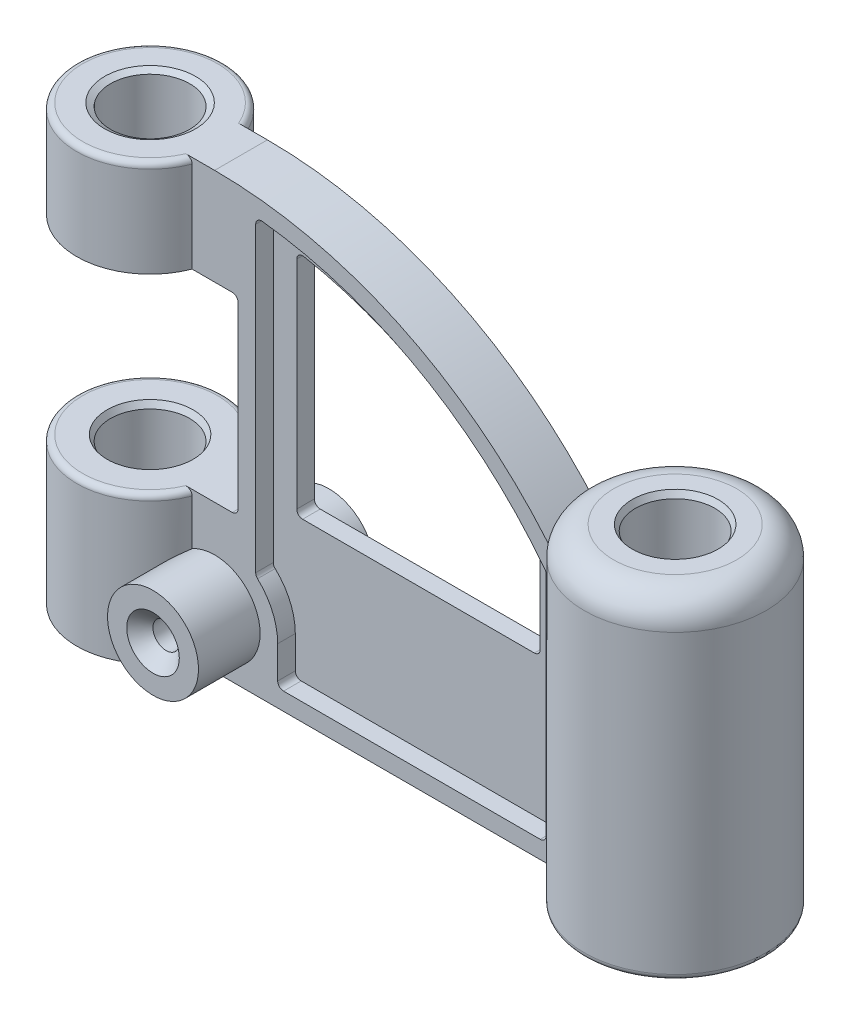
ISO-10303-21;
HEADER;
FILE_DESCRIPTION(('STEP AP214'),'2;1');
FILE_NAME('part.step','',(''),(''),'','','');
FILE_SCHEMA(('AUTOMOTIVE_DESIGN { 1 0 10303 214 1 1 1 1 }'));
ENDSEC;
DATA;
#1=APPLICATION_CONTEXT('core data for automotive mechanical design processes');
#2=APPLICATION_PROTOCOL_DEFINITION('international standard','automotive_design',2000,#1);
#3=PRODUCT_CONTEXT('',#1,'mechanical');
#4=PRODUCT('Part','Part','',(#3));
#5=PRODUCT_RELATED_PRODUCT_CATEGORY('part','',(#4));
#6=PRODUCT_DEFINITION_FORMATION('','',#4);
#7=PRODUCT_DEFINITION_CONTEXT('part definition',#1,'design');
#8=PRODUCT_DEFINITION('design','',#6,#7);
#9=PRODUCT_DEFINITION_SHAPE('','',#8);
#10=(LENGTH_UNIT() NAMED_UNIT(*) SI_UNIT(.MILLI.,.METRE.));
#11=(NAMED_UNIT(*) PLANE_ANGLE_UNIT() SI_UNIT($,.RADIAN.));
#12=(NAMED_UNIT(*) SI_UNIT($,.STERADIAN.) SOLID_ANGLE_UNIT());
#13=UNCERTAINTY_MEASURE_WITH_UNIT(LENGTH_MEASURE(1.E-05),#10,'distance_accuracy_value','');
#14=(GEOMETRIC_REPRESENTATION_CONTEXT(3) GLOBAL_UNCERTAINTY_ASSIGNED_CONTEXT((#13)) GLOBAL_UNIT_ASSIGNED_CONTEXT((#10,
#11,#12)) REPRESENTATION_CONTEXT('',''));
#15=CARTESIAN_POINT('',(0.,0.,0.));
#16=DIRECTION('',(0.,0.,1.));
#17=DIRECTION('',(1.,0.,0.));
#18=AXIS2_PLACEMENT_3D('',#15,#16,#17);
#19=CARTESIAN_POINT('',(23.3238075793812,148.,-9.));
#20=DIRECTION('',(0.,0.,1.));
#21=DIRECTION('',(1.,0.,0.));
#22=AXIS2_PLACEMENT_3D('',#19,#20,#21);
#23=PLANE('',#22);
#24=DIRECTION('',(0.,-1.,0.));
#25=VECTOR('',#24,1.);
#26=CARTESIAN_POINT('',(23.3238075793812,148.,-9.));
#27=LINE('',#26,#25);
#28=CARTESIAN_POINT('',(23.3238075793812,48.,-9.));
#29=VERTEX_POINT('',#28);
#30=CARTESIAN_POINT('',(23.3238075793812,32.4657368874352,-8.99999999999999));
#31=VERTEX_POINT('',#30);
#32=EDGE_CURVE('E525',#29,#31,#27,.T.);
#33=ORIENTED_EDGE('',*,*,#32,.F.);
#34=CARTESIAN_POINT('',(23.3238075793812,48.,-9.));
#35=CARTESIAN_POINT('',(23.3238150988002,48.0534662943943,-9.));
#36=CARTESIAN_POINT('',(23.3215096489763,48.1069289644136,-9.));
#37=CARTESIAN_POINT('',(23.3123305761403,48.2134516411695,-9.));
#38=CARTESIAN_POINT('',(23.305457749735,48.2665117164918,-9.));
#39=CARTESIAN_POINT('',(23.2872242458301,48.3717223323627,-9.));
#40=CARTESIAN_POINT('',(23.2758747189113,48.4238747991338,-9.));
#41=CARTESIAN_POINT('',(23.2488099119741,48.5270198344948,-9.));
#42=CARTESIAN_POINT('',(23.2330945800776,48.5780123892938,-9.));
#43=CARTESIAN_POINT('',(23.1796063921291,48.7287024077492,-9.));
#44=CARTESIAN_POINT('',(23.1354720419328,48.8262221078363,-9.));
#45=CARTESIAN_POINT('',(23.0318807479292,49.0126886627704,-9.));
#46=CARTESIAN_POINT('',(22.9724189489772,49.1016327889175,-9.));
#47=CARTESIAN_POINT('',(22.8384005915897,49.271153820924,-9.));
#48=CARTESIAN_POINT('',(22.7634885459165,49.3514495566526,-9.));
#49=CARTESIAN_POINT('',(22.6019736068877,49.4992330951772,-9.));
#50=CARTESIAN_POINT('',(22.5153682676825,49.5667182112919,-9.));
#51=CARTESIAN_POINT('',(22.3270975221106,49.6915750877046,-9.));
#52=CARTESIAN_POINT('',(22.2248243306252,49.7480293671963,-9.));
#53=CARTESIAN_POINT('',(22.0126831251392,49.8442721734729,-9.));
#54=CARTESIAN_POINT('',(21.9028112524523,49.8840521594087,-9.));
#55=CARTESIAN_POINT('',(21.6889620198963,49.9434987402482,-9.));
#56=CARTESIAN_POINT('',(21.5854087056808,49.9647107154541,-9.));
#57=CARTESIAN_POINT('',(21.3765677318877,49.9929607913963,-9.));
#58=CARTESIAN_POINT('',(21.271283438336,50.0000237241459,-9.));
#59=CARTESIAN_POINT('',(21.1660104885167,50.,-9.));
#60=B_SPLINE_CURVE_WITH_KNOTS('',3,(#34,#35,#36,#37,#38,#39,#40,#41,#42,#43,#44,#45,#46,#47,#48,
#49,#50,#51,#52,#53,#54,#55,#56,#57,#58,#59),.UNSPECIFIED.,.F.,.F.,(4,2,2,2,2,2,2,2,2,2,2,2,4),
(0.,0.160342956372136,0.320657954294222,0.480576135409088,0.640496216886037,0.960005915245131,
1.27961694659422,1.60762371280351,1.93569919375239,2.28466302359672,2.63380538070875,
2.9499562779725,3.26555183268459),.UNSPECIFIED.);
#61=CARTESIAN_POINT('',(21.1660104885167,50.,-9.));
#62=VERTEX_POINT('',#61);
#63=EDGE_CURVE('E726',#29,#62,#60,.T.);
#64=ORIENTED_EDGE('',*,*,#63,.T.);
#65=DIRECTION('',(1.,0.,0.));
#66=VECTOR('',#65,1.);
#67=CARTESIAN_POINT('',(23.3238075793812,50.,-9.));
#68=LINE('',#67,#66);
#69=CARTESIAN_POINT('',(37.,50.,-9.));
#70=VERTEX_POINT('',#69);
#71=EDGE_CURVE('E436',#62,#70,#68,.T.);
#72=ORIENTED_EDGE('',*,*,#71,.T.);
#73=CARTESIAN_POINT('',(37.,52.,-9.));
#74=DIRECTION('',(0.,0.,1.));
#75=DIRECTION('',(1.,0.,0.));
#76=AXIS2_PLACEMENT_3D('',#73,#74,#75);
#77=CIRCLE('',#76,2.);
#78=CARTESIAN_POINT('',(39.,52.,-9.));
#79=VERTEX_POINT('',#78);
#80=EDGE_CURVE('E1038',#70,#79,#77,.T.);
#81=ORIENTED_EDGE('',*,*,#80,.T.);
#82=DIRECTION('',(0.,1.,0.));
#83=VECTOR('',#82,1.);
#84=CARTESIAN_POINT('',(39.,148.,-9.));
#85=LINE('',#84,#83);
#86=CARTESIAN_POINT('',(39.,113.,-9.));
#87=VERTEX_POINT('',#86);
#88=EDGE_CURVE('E439',#79,#87,#85,.T.);
#89=ORIENTED_EDGE('',*,*,#88,.T.);
#90=CARTESIAN_POINT('',(37.,113.,-9.));
#91=DIRECTION('',(0.,0.,1.));
#92=DIRECTION('',(1.,0.,0.));
#93=AXIS2_PLACEMENT_3D('',#90,#91,#92);
#94=CIRCLE('',#93,2.);
#95=CARTESIAN_POINT('',(37.,115.,-9.));
#96=VERTEX_POINT('',#95);
#97=EDGE_CURVE('E12',#87,#96,#94,.T.);
#98=ORIENTED_EDGE('',*,*,#97,.T.);
#99=DIRECTION('',(-1.,0.,0.));
#100=VECTOR('',#99,1.);
#101=CARTESIAN_POINT('',(23.3238075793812,115.,-9.));
#102=LINE('',#101,#100);
#103=CARTESIAN_POINT('',(23.3238075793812,115.,-9.));
#104=VERTEX_POINT('',#103);
#105=EDGE_CURVE('E432',#96,#104,#102,.T.);
#106=ORIENTED_EDGE('',*,*,#105,.T.);
#107=CARTESIAN_POINT('',(23.3238075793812,146.,-9.));
#108=VERTEX_POINT('',#107);
#109=EDGE_CURVE('E521',#108,#104,#27,.T.);
#110=ORIENTED_EDGE('',*,*,#109,.F.);
#111=CARTESIAN_POINT('',(23.3238075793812,146.,-9.));
#112=CARTESIAN_POINT('',(23.3238150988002,146.053466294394,-9.));
#113=CARTESIAN_POINT('',(23.3215096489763,146.106928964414,-9.));
#114=CARTESIAN_POINT('',(23.3123305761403,146.21345164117,-9.));
#115=CARTESIAN_POINT('',(23.305457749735,146.266511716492,-9.));
#116=CARTESIAN_POINT('',(23.2872242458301,146.371722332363,-9.));
#117=CARTESIAN_POINT('',(23.2758747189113,146.423874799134,-9.));
#118=CARTESIAN_POINT('',(23.2488099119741,146.527019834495,-9.));
#119=CARTESIAN_POINT('',(23.2330945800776,146.578012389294,-9.));
#120=CARTESIAN_POINT('',(23.1796063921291,146.728702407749,-9.));
#121=CARTESIAN_POINT('',(23.1354720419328,146.826222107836,-9.));
#122=CARTESIAN_POINT('',(23.0318807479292,147.01268866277,-9.));
#123=CARTESIAN_POINT('',(22.9724189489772,147.101632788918,-9.));
#124=CARTESIAN_POINT('',(22.8384005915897,147.271153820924,-9.));
#125=CARTESIAN_POINT('',(22.7634885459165,147.351449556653,-9.));
#126=CARTESIAN_POINT('',(22.6019736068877,147.499233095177,-9.));
#127=CARTESIAN_POINT('',(22.5153682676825,147.566718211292,-9.));
#128=CARTESIAN_POINT('',(22.3270975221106,147.691575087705,-9.));
#129=CARTESIAN_POINT('',(22.2248243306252,147.748029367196,-9.));
#130=CARTESIAN_POINT('',(22.0126831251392,147.844272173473,-9.));
#131=CARTESIAN_POINT('',(21.9028112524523,147.884052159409,-9.));
#132=CARTESIAN_POINT('',(21.6889620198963,147.943498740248,-9.));
#133=CARTESIAN_POINT('',(21.5854087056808,147.964710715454,-9.));
#134=CARTESIAN_POINT('',(21.3765677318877,147.992960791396,-9.));
#135=CARTESIAN_POINT('',(21.271283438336,148.000023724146,-9.));
#136=CARTESIAN_POINT('',(21.1660104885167,148.,-9.));
#137=B_SPLINE_CURVE_WITH_KNOTS('',3,(#111,#112,#113,#114,#115,#116,#117,#118,#119,#120,#121,
#122,#123,#124,#125,#126,#127,#128,#129,#130,#131,#132,#133,#134,#135,#136),.UNSPECIFIED.,.F.,
.F.,(4,2,2,2,2,2,2,2,2,2,2,2,4),(0.,0.160342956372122,0.320657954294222,0.480576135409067,
0.64049621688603,0.960005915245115,1.27961694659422,1.60762371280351,1.93569919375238,
2.28466302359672,2.63380538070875,2.94995627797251,3.26555183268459),.UNSPECIFIED.);
#138=CARTESIAN_POINT('',(21.1660104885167,148.,-9.));
#139=VERTEX_POINT('',#138);
#140=EDGE_CURVE('E981',#108,#139,#137,.T.);
#141=ORIENTED_EDGE('',*,*,#140,.T.);
#142=DIRECTION('',(-1.,0.,0.));
#143=VECTOR('',#142,1.);
#144=CARTESIAN_POINT('',(23.3238075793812,148.,-9.));
#145=LINE('',#144,#143);
#146=CARTESIAN_POINT('',(31.,148.,-9.));
#147=VERTEX_POINT('',#146);
#148=EDGE_CURVE('E501',#147,#139,#145,.T.);
#149=ORIENTED_EDGE('',*,*,#148,.F.);
#150=CARTESIAN_POINT('',(31.,0.,-9.));
#151=DIRECTION('',(0.,0.,1.));
#152=DIRECTION('',(1.,0.,0.));
#153=AXIS2_PLACEMENT_3D('',#150,#151,#152);
#154=CIRCLE('',#153,148.);
#155=CARTESIAN_POINT('',(149.335206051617,88.8863263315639,-9.));
#156=VERTEX_POINT('',#155);
#157=EDGE_CURVE('E497',#147,#156,#154,.F.);
#158=ORIENTED_EDGE('',*,*,#157,.T.);
#159=DIRECTION('',(0.,-1.,0.));
#160=VECTOR('',#159,1.);
#161=CARTESIAN_POINT('',(149.335206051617,148.,-9.));
#162=LINE('',#161,#160);
#163=CARTESIAN_POINT('',(149.335206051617,2.,-9.));
#164=VERTEX_POINT('',#163);
#165=EDGE_CURVE('E524',#156,#164,#162,.T.);
#166=ORIENTED_EDGE('',*,*,#165,.T.);
#167=CARTESIAN_POINT('',(149.335206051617,2.,-9.));
#168=CARTESIAN_POINT('',(149.33520523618,1.94551813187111,-9.));
#169=CARTESIAN_POINT('',(149.337534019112,1.89106296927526,-9.));
#170=CARTESIAN_POINT('',(149.346816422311,1.782555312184,-9.));
#171=CARTESIAN_POINT('',(149.353769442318,1.72850276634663,-9.));
#172=CARTESIAN_POINT('',(149.38146284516,1.56774990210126,-9.));
#173=CARTESIAN_POINT('',(149.409038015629,1.46214780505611,-9.));
#174=CARTESIAN_POINT('',(149.481466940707,1.25711128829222,-9.));
#175=CARTESIAN_POINT('',(149.52632212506,1.15767737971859,-9.));
#176=CARTESIAN_POINT('',(149.631813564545,0.967553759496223,-9.));
#177=CARTESIAN_POINT('',(149.692452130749,0.876865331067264,-9.));
#178=CARTESIAN_POINT('',(149.828775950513,0.705012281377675,-9.));
#179=CARTESIAN_POINT('',(149.90470632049,0.624042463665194,-9.));
#180=CARTESIAN_POINT('',(150.068610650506,0.475382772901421,-9.));
#181=CARTESIAN_POINT('',(150.156587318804,0.407695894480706,-9.));
#182=CARTESIAN_POINT('',(150.345905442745,0.284552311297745,-9.));
#183=CARTESIAN_POINT('',(150.447647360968,0.22971196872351,-9.));
#184=CARTESIAN_POINT('',(150.658623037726,0.137074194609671,-9.));
#185=CARTESIAN_POINT('',(150.767857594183,0.099278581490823,-9.));
#186=CARTESIAN_POINT('',(150.969533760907,0.0469412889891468,-9.));
#187=CARTESIAN_POINT('',(151.061196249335,0.0293363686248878,-9.));
#188=CARTESIAN_POINT('',(151.245869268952,0.00586547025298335,-9.));
#189=CARTESIAN_POINT('',(151.338877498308,-1.86045870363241E-05,-9.));
#190=CARTESIAN_POINT('',(151.43190249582,0.,-9.));
#191=B_SPLINE_CURVE_WITH_KNOTS('',3,(#167,#168,#169,#170,#171,#172,#173,#174,#175,#176,#177,
#178,#179,#180,#181,#182,#183,#184,#185,#186,#187,#188,#189,#190),.UNSPECIFIED.,.F.,.F.,(4,2,2,
2,2,2,2,2,2,2,2,4),(0.,0.16334313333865,0.32666506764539,0.652401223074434,0.978164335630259,
1.30397517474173,1.63549703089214,1.96709354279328,2.31230683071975,2.65755693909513,
2.9368422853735,3.21569608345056),.UNSPECIFIED.);
#192=CARTESIAN_POINT('',(151.43190249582,0.,-9.));
#193=VERTEX_POINT('',#192);
#194=EDGE_CURVE('E694',#164,#193,#191,.T.);
#195=ORIENTED_EDGE('',*,*,#194,.T.);
#196=DIRECTION('',(-1.,0.,0.));
#197=VECTOR('',#196,1.);
#198=CARTESIAN_POINT('',(23.3238075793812,0.,-9.));
#199=LINE('',#198,#197);
#200=CARTESIAN_POINT('',(23.3238075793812,0.,-9.));
#201=VERTEX_POINT('',#200);
#202=EDGE_CURVE('E500',#193,#201,#199,.T.);
#203=ORIENTED_EDGE('',*,*,#202,.T.);
#204=CARTESIAN_POINT('',(23.3238075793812,5.53426311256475,-9.));
#205=VERTEX_POINT('',#204);
#206=EDGE_CURVE('E519',#205,#201,#27,.T.);
#207=ORIENTED_EDGE('',*,*,#206,.F.);
#208=CARTESIAN_POINT('',(31.,19.,-9.));
#209=DIRECTION('',(0.,0.,1.));
#210=DIRECTION('',(1.,0.,0.));
#211=AXIS2_PLACEMENT_3D('',#208,#209,#210);
#212=CIRCLE('',#211,15.5);
#213=EDGE_CURVE('E493',#31,#205,#212,.F.);
#214=ORIENTED_EDGE('',*,*,#213,.F.);
#215=EDGE_LOOP('',(#33,#64,#72,#81,#89,#98,#106,#110,#141,#149,#158,#166,#195,#203,#207,#214));
#216=FACE_BOUND('',#215,.T.);
#217=DIRECTION('',(0.,-1.,0.));
#218=VECTOR('',#217,1.);
#219=CARTESIAN_POINT('',(52.5,19.,-9.));
#220=LINE('',#219,#218);
#221=CARTESIAN_POINT('',(52.5,19.,-9.));
#222=VERTEX_POINT('',#221);
#223=CARTESIAN_POINT('',(52.5,8.,-9.));
#224=VERTEX_POINT('',#223);
#225=EDGE_CURVE('E352',#222,#224,#220,.T.);
#226=ORIENTED_EDGE('',*,*,#225,.T.);
#227=CARTESIAN_POINT('',(54.5,8.,-9.));
#228=DIRECTION('',(0.,0.,1.));
#229=DIRECTION('',(1.,0.,0.));
#230=AXIS2_PLACEMENT_3D('',#227,#228,#229);
#231=CIRCLE('',#230,2.);
#232=CARTESIAN_POINT('',(54.5,6.,-9.));
#233=VERTEX_POINT('',#232);
#234=EDGE_CURVE('E662',#224,#233,#231,.T.);
#235=ORIENTED_EDGE('',*,*,#234,.T.);
#236=DIRECTION('',(1.,0.,0.));
#237=VECTOR('',#236,1.);
#238=CARTESIAN_POINT('',(52.5,6.,-9.));
#239=LINE('',#238,#237);
#240=CARTESIAN_POINT('',(142.,6.,-9.));
#241=VERTEX_POINT('',#240);
#242=EDGE_CURVE('E375',#233,#241,#239,.T.);
#243=ORIENTED_EDGE('',*,*,#242,.T.);
#244=CARTESIAN_POINT('',(142.,8.,-9.));
#245=DIRECTION('',(0.,0.,1.));
#246=DIRECTION('',(1.,0.,0.));
#247=AXIS2_PLACEMENT_3D('',#244,#245,#246);
#248=CIRCLE('',#247,2.);
#249=CARTESIAN_POINT('',(144.,8.00000000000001,-9.));
#250=VERTEX_POINT('',#249);
#251=EDGE_CURVE('E658',#241,#250,#248,.T.);
#252=ORIENTED_EDGE('',*,*,#251,.T.);
#253=DIRECTION('',(0.,1.,0.));
#254=VECTOR('',#253,1.);
#255=CARTESIAN_POINT('',(144.,85.9941858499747,-9.));
#256=LINE('',#255,#254);
#257=CARTESIAN_POINT('',(144.,85.3170557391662,-9.));
#258=VERTEX_POINT('',#257);
#259=EDGE_CURVE('E364',#250,#258,#256,.T.);
#260=ORIENTED_EDGE('',*,*,#259,.T.);
#261=CARTESIAN_POINT('',(142.,85.3170557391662,-9.));
#262=DIRECTION('',(0.,0.,1.));
#263=DIRECTION('',(1.,0.,0.));
#264=AXIS2_PLACEMENT_3D('',#261,#262,#263);
#265=CIRCLE('',#264,2.);
#266=CARTESIAN_POINT('',(143.585714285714,86.5358708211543,-9.));
#267=VERTEX_POINT('',#266);
#268=EDGE_CURVE('E666',#258,#267,#265,.T.);
#269=ORIENTED_EDGE('',*,*,#268,.T.);
#270=CARTESIAN_POINT('',(31.,0.,-9.));
#271=DIRECTION('',(0.,0.,1.));
#272=DIRECTION('',(1.,0.,0.));
#273=AXIS2_PLACEMENT_3D('',#270,#271,#272);
#274=CIRCLE('',#273,142.);
#275=CARTESIAN_POINT('',(47.2285714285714,141.069605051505,-9.));
#276=VERTEX_POINT('',#275);
#277=EDGE_CURVE('E385',#267,#276,#274,.T.);
#278=ORIENTED_EDGE('',*,*,#277,.T.);
#279=CARTESIAN_POINT('',(47.,139.08270920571,-9.));
#280=DIRECTION('',(0.,0.,1.));
#281=DIRECTION('',(1.,0.,0.));
#282=AXIS2_PLACEMENT_3D('',#279,#280,#281);
#283=CIRCLE('',#282,2.);
#284=CARTESIAN_POINT('',(45.,139.08270920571,-9.));
#285=VERTEX_POINT('',#284);
#286=EDGE_CURVE('E664',#276,#285,#283,.T.);
#287=ORIENTED_EDGE('',*,*,#286,.T.);
#288=DIRECTION('',(0.,-1.,0.));
#289=VECTOR('',#288,1.);
#290=CARTESIAN_POINT('',(45.,141.308173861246,-9.));
#291=LINE('',#290,#289);
#292=CARTESIAN_POINT('',(45.,36.2119144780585,-9.));
#293=VERTEX_POINT('',#292);
#294=EDGE_CURVE('E382',#285,#293,#291,.T.);
#295=ORIENTED_EDGE('',*,*,#294,.T.);
#296=CARTESIAN_POINT('',(47.,36.2119144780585,-9.));
#297=DIRECTION('',(0.,0.,1.));
#298=DIRECTION('',(1.,0.,0.));
#299=AXIS2_PLACEMENT_3D('',#296,#297,#298);
#300=CIRCLE('',#299,2.);
#301=CARTESIAN_POINT('',(45.6382978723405,34.7470706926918,-9.));
#302=VERTEX_POINT('',#301);
#303=EDGE_CURVE('E660',#293,#302,#300,.T.);
#304=ORIENTED_EDGE('',*,*,#303,.T.);
#305=CARTESIAN_POINT('',(31.,19.,-9.));
#306=DIRECTION('',(0.,0.,-1.));
#307=DIRECTION('',(1.,0.,0.));
#308=AXIS2_PLACEMENT_3D('',#305,#306,#307);
#309=CIRCLE('',#308,21.5);
#310=EDGE_CURVE('E380',#302,#222,#309,.T.);
#311=ORIENTED_EDGE('',*,*,#310,.T.);
#312=EDGE_LOOP('',(#226,#235,#243,#252,#260,#269,#278,#287,#295,#304,#311));
#313=FACE_BOUND('',#312,.T.);
#314=ADVANCED_FACE('F40',(#216,#313),#23,.F.);
#315=CARTESIAN_POINT('',(0.,148.,0.));
#316=DIRECTION('',(0.,-1.,0.));
#317=DIRECTION('',(0.,0.,-1.));
#318=AXIS2_PLACEMENT_3D('',#315,#316,#317);
#319=CYLINDRICAL_SURFACE('',#318,25.);
#320=DIRECTION('',(0.,-1.,0.));
#321=VECTOR('',#320,1.);
#322=CARTESIAN_POINT('',(23.3238075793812,148.,8.99999999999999));
#323=LINE('',#322,#321);
#324=CARTESIAN_POINT('',(23.3238075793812,48.,8.99999999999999));
#325=VERTEX_POINT('',#324);
#326=CARTESIAN_POINT('',(23.3238075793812,32.4657368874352,9.));
#327=VERTEX_POINT('',#326);
#328=EDGE_CURVE('E520',#325,#327,#323,.T.);
#329=ORIENTED_EDGE('',*,*,#328,.F.);
#330=CARTESIAN_POINT('',(0.,48.,0.));
#331=DIRECTION('',(0.,-1.,0.));
#332=DIRECTION('',(0.,0.,-1.));
#333=AXIS2_PLACEMENT_3D('',#330,#331,#332);
#334=CIRCLE('',#333,25.);
#335=EDGE_CURVE('E647',#325,#29,#334,.T.);
#336=ORIENTED_EDGE('',*,*,#335,.T.);
#337=ORIENTED_EDGE('',*,*,#32,.T.);
#338=CARTESIAN_POINT('',(23.3238075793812,5.53426311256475,-8.99999999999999));
#339=CARTESIAN_POINT('',(23.2397142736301,5.58220665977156,-9.21793718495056));
#340=CARTESIAN_POINT('',(23.1527639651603,5.63281050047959,-9.43416792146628));
#341=CARTESIAN_POINT('',(22.973385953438,5.73974344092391,-9.86293791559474));
#342=CARTESIAN_POINT('',(22.8809576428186,5.79607317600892,-10.0754767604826));
#343=CARTESIAN_POINT('',(22.5956390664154,5.97436695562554,-10.7075098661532));
#344=CARTESIAN_POINT('',(22.3948937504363,6.10553603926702,-11.1209592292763));
#345=CARTESIAN_POINT('',(21.9741617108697,6.3964288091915,-11.9308720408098));
#346=CARTESIAN_POINT('',(21.7540708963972,6.55631249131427,-12.327224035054));
#347=CARTESIAN_POINT('',(21.2994918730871,6.90733659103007,-13.096991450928));
#348=CARTESIAN_POINT('',(21.0650117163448,7.0984596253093,-13.4704194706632));
#349=CARTESIAN_POINT('',(20.6287024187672,7.47809250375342,-14.1274061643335));
#350=CARTESIAN_POINT('',(20.4284257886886,7.66109565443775,-14.4151845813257));
#351=CARTESIAN_POINT('',(20.0245222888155,8.05158612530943,-14.9711896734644));
#352=CARTESIAN_POINT('',(19.8208954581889,8.25907315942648,-15.2394165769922));
#353=CARTESIAN_POINT('',(19.4145472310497,8.69870900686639,-15.753809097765));
#354=CARTESIAN_POINT('',(19.2118249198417,8.93078469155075,-16.0000363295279));
#355=CARTESIAN_POINT('',(18.8106794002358,9.42030437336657,-16.4697829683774));
#356=CARTESIAN_POINT('',(18.6122561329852,9.67774802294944,-16.6933026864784));
#357=CARTESIAN_POINT('',(18.222531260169,10.2194323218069,-17.1179150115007));
#358=CARTESIAN_POINT('',(18.0312894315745,10.5038484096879,-17.3188391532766));
#359=CARTESIAN_POINT('',(17.6617024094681,11.0967210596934,-17.6955912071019));
#360=CARTESIAN_POINT('',(17.4833576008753,11.4051783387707,-17.8714183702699));
#361=CARTESIAN_POINT('',(17.1435648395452,12.0444050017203,-18.1976298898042));
#362=CARTESIAN_POINT('',(16.9821281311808,12.3751889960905,-18.3479973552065));
#363=CARTESIAN_POINT('',(16.6800314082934,13.0563266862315,-18.623059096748));
#364=CARTESIAN_POINT('',(16.5393693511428,13.4066784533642,-18.7477558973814));
#365=CARTESIAN_POINT('',(16.2957320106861,14.0856900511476,-18.959755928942));
#366=CARTESIAN_POINT('',(16.1903384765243,14.4126860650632,-19.0496272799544));
#367=CARTESIAN_POINT('',(16.0005567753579,15.0774799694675,-19.2093097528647));
#368=CARTESIAN_POINT('',(15.9161670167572,15.4152770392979,-19.2791223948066));
#369=CARTESIAN_POINT('',(15.7698774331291,16.099038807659,-19.3989668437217));
#370=CARTESIAN_POINT('',(15.7079710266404,16.4450010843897,-19.4490044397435));
#371=CARTESIAN_POINT('',(15.6076618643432,17.1425602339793,-19.5295940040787));
#372=CARTESIAN_POINT('',(15.5692590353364,17.4941570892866,-19.560146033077));
#373=CARTESIAN_POINT('',(15.5174802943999,18.1884186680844,-19.6012461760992));
#374=CARTESIAN_POINT('',(15.5033068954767,18.5309866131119,-19.6124318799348));
#375=CARTESIAN_POINT('',(15.4977222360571,19.2164166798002,-19.6168453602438));
#376=CARTESIAN_POINT('',(15.5063102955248,19.5592787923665,-19.6100736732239));
#377=CARTESIAN_POINT('',(15.5461140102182,20.2428196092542,-19.5785336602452));
#378=CARTESIAN_POINT('',(15.5773274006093,20.5834985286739,-19.5537671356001));
#379=CARTESIAN_POINT('',(15.6618958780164,21.2602776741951,-19.486096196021));
#380=CARTESIAN_POINT('',(15.7152510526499,21.5963778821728,-19.4431917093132));
#381=CARTESIAN_POINT('',(15.8431135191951,22.2608256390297,-19.3391448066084));
#382=CARTESIAN_POINT('',(15.9175711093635,22.5891894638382,-19.2780452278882));
#383=CARTESIAN_POINT('',(16.08649549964,23.2366638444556,-19.1373126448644));
#384=CARTESIAN_POINT('',(16.1809621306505,23.5557744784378,-19.057679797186));
#385=CARTESIAN_POINT('',(16.3883520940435,24.1825382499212,-18.8796339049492));
#386=CARTESIAN_POINT('',(16.5012748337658,24.4901917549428,-18.7812214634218));
#387=CARTESIAN_POINT('',(16.7436849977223,25.0920215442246,-18.5654336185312));
#388=CARTESIAN_POINT('',(16.8731724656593,25.3861977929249,-18.4480581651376));
#389=CARTESIAN_POINT('',(17.147388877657,25.9611246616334,-18.1934675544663));
#390=CARTESIAN_POINT('',(17.2922109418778,26.2417761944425,-18.0561290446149));
#391=CARTESIAN_POINT('',(17.5938806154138,26.7860636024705,-17.7623105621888));
#392=CARTESIAN_POINT('',(17.7507281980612,27.049699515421,-17.6058306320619));
#393=CARTESIAN_POINT('',(18.0736604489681,27.5586529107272,-17.2741518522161));
#394=CARTESIAN_POINT('',(18.2397403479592,27.8039797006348,-17.0989626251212));
#395=CARTESIAN_POINT('',(18.5784156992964,28.2756977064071,-16.7303646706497));
#396=CARTESIAN_POINT('',(18.7510113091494,28.5020884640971,-16.5369555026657));
#397=CARTESIAN_POINT('',(19.1081213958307,28.9457571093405,-16.1232071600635));
#398=CARTESIAN_POINT('',(19.2928150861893,29.1621086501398,-15.9020301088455));
#399=CARTESIAN_POINT('',(19.6632128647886,29.5737383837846,-15.4416755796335));
#400=CARTESIAN_POINT('',(19.848916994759,29.7690156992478,-15.2024973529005));
#401=CARTESIAN_POINT('',(20.2188876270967,30.1394029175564,-14.7068830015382));
#402=CARTESIAN_POINT('',(20.4031500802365,30.3144676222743,-14.4504101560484));
#403=CARTESIAN_POINT('',(20.7672467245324,30.6447926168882,-13.9220840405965));
#404=CARTESIAN_POINT('',(20.9470809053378,30.800052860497,-13.6502307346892));
#405=CARTESIAN_POINT('',(21.333650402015,31.1196533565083,-13.0395362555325));
#406=CARTESIAN_POINT('',(21.5390022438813,31.2801106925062,-12.6977836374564));
#407=CARTESIAN_POINT('',(21.9371655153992,31.5768327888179,-11.9968076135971));
#408=CARTESIAN_POINT('',(22.1299721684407,31.713088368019,-11.6375776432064));
#409=CARTESIAN_POINT('',(22.4996314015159,31.9631521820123,-10.9056805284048));
#410=CARTESIAN_POINT('',(22.6765525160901,32.0770596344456,-10.5330818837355));
#411=CARTESIAN_POINT('',(22.929147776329,32.2333336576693,-9.96479681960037));
#412=CARTESIAN_POINT('',(23.0111880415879,32.2829786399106,-9.77387398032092));
#413=CARTESIAN_POINT('',(23.1708518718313,32.3777066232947,-9.38909002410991));
#414=CARTESIAN_POINT('',(23.2484757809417,32.4227899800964,-9.19522913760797));
#415=CARTESIAN_POINT('',(23.3238075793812,32.4657368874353,-9.00000000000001));
#416=B_SPLINE_CURVE_WITH_KNOTS('',3,(#338,#339,#340,#341,#342,#343,#344,#345,#346,#347,#348,
#349,#350,#351,#352,#353,#354,#355,#356,#357,#358,#359,#360,#361,#362,#363,#364,#365,#366,#367,
#368,#369,#370,#371,#372,#373,#374,#375,#376,#377,#378,#379,#380,#381,#382,#383,#384,#385,#386,
#387,#388,#389,#390,#391,#392,#393,#394,#395,#396,#397,#398,#399,#400,#401,#402,#403,#404,#405,
#406,#407,#408,#409,#410,#411,#412,#413,#414,#415),.UNSPECIFIED.,.F.,.F.,(4,2,2,2,2,2,2,2,2,2,2,
2,2,2,2,2,2,2,2,2,2,2,2,2,2,2,2,2,2,2,2,2,2,2,2,2,2,2,4),(0.,0.715326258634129,1.43073197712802,
2.86305384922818,4.3036191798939,5.74338561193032,6.9287224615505,8.11404546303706,
9.29593723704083,10.4778128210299,11.6679857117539,12.858194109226,14.0491890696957,
15.2400668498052,16.3041109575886,17.368074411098,18.4317261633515,19.4953746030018,
20.5232874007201,21.5511694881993,22.5789486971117,23.6067319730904,24.6321143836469,
25.6574881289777,26.6828289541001,27.7081724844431,28.7401445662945,29.772114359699,
30.8035559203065,31.8350224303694,32.9148980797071,33.9948186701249,35.0771091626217,
36.1594021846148,37.4474007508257,38.7358868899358,40.0185163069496,40.6593723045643,
41.3001782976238),.UNSPECIFIED.);
#417=EDGE_CURVE('E462',#205,#31,#416,.T.);
#418=ORIENTED_EDGE('',*,*,#417,.F.);
#419=ORIENTED_EDGE('',*,*,#206,.T.);
#420=CARTESIAN_POINT('',(0.,0.,0.));
#421=DIRECTION('',(0.,1.,0.));
#422=DIRECTION('',(0.,0.,1.));
#423=AXIS2_PLACEMENT_3D('',#420,#421,#422);
#424=CIRCLE('',#423,25.);
#425=CARTESIAN_POINT('',(23.3238075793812,0.,8.99999999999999));
#426=VERTEX_POINT('',#425);
#427=EDGE_CURVE('E510',#201,#426,#424,.T.);
#428=ORIENTED_EDGE('',*,*,#427,.T.);
#429=CARTESIAN_POINT('',(23.3238075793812,5.53426311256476,9.));
#430=VERTEX_POINT('',#429);
#431=EDGE_CURVE('E516',#430,#426,#323,.T.);
#432=ORIENTED_EDGE('',*,*,#431,.F.);
#433=CARTESIAN_POINT('',(23.3238075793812,32.4657368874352,8.99999999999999));
#434=CARTESIAN_POINT('',(23.2397142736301,32.4177933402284,9.21793718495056));
#435=CARTESIAN_POINT('',(23.1527639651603,32.3671894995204,9.43416792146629));
#436=CARTESIAN_POINT('',(22.973385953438,32.2602565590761,9.86293791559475));
#437=CARTESIAN_POINT('',(22.8809576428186,32.2039268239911,10.0754767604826));
#438=CARTESIAN_POINT('',(22.5956390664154,32.0256330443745,10.7075098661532));
#439=CARTESIAN_POINT('',(22.3948937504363,31.894463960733,11.1209592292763));
#440=CARTESIAN_POINT('',(21.9741617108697,31.6035711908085,11.9308720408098));
#441=CARTESIAN_POINT('',(21.7540708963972,31.4436875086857,12.327224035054));
#442=CARTESIAN_POINT('',(21.2994918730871,31.0926634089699,13.096991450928));
#443=CARTESIAN_POINT('',(21.0650117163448,30.9015403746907,13.4704194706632));
#444=CARTESIAN_POINT('',(20.6287024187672,30.5219074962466,14.1274061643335));
#445=CARTESIAN_POINT('',(20.4284257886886,30.3389043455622,14.4151845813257));
#446=CARTESIAN_POINT('',(20.0245222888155,29.9484138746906,14.9711896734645));
#447=CARTESIAN_POINT('',(19.8208954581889,29.7409268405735,15.2394165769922));
#448=CARTESIAN_POINT('',(19.4145472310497,29.3012909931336,15.753809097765));
#449=CARTESIAN_POINT('',(19.2118249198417,29.0692153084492,16.0000363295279));
#450=CARTESIAN_POINT('',(18.8106794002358,28.5796956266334,16.4697829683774));
#451=CARTESIAN_POINT('',(18.6122561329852,28.3222519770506,16.6933026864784));
#452=CARTESIAN_POINT('',(18.222531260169,27.7805676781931,17.1179150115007));
#453=CARTESIAN_POINT('',(18.0312894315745,27.4961515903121,17.3188391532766));
#454=CARTESIAN_POINT('',(17.6617024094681,26.9032789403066,17.6955912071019));
#455=CARTESIAN_POINT('',(17.4833576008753,26.5948216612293,17.8714183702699));
#456=CARTESIAN_POINT('',(17.1435648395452,25.9555949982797,18.1976298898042));
#457=CARTESIAN_POINT('',(16.9821281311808,25.6248110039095,18.3479973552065));
#458=CARTESIAN_POINT('',(16.6800314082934,24.9436733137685,18.623059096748));
#459=CARTESIAN_POINT('',(16.5393693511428,24.5933215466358,18.7477558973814));
#460=CARTESIAN_POINT('',(16.2957320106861,23.9143099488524,18.959755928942));
#461=CARTESIAN_POINT('',(16.1903384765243,23.5873139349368,19.0496272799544));
#462=CARTESIAN_POINT('',(16.0005567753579,22.9225200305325,19.2093097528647));
#463=CARTESIAN_POINT('',(15.9161670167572,22.5847229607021,19.2791223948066));
#464=CARTESIAN_POINT('',(15.7698774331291,21.900961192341,19.3989668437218));
#465=CARTESIAN_POINT('',(15.7079710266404,21.5549989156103,19.4490044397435));
#466=CARTESIAN_POINT('',(15.6076618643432,20.8574397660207,19.5295940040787));
#467=CARTESIAN_POINT('',(15.5692590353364,20.5058429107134,19.560146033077));
#468=CARTESIAN_POINT('',(15.5174802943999,19.8115813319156,19.6012461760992));
#469=CARTESIAN_POINT('',(15.5033068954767,19.4690133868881,19.6124318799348));
#470=CARTESIAN_POINT('',(15.4977222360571,18.7835833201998,19.6168453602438));
#471=CARTESIAN_POINT('',(15.5063102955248,18.4407212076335,19.6100736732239));
#472=CARTESIAN_POINT('',(15.5461140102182,17.7571803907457,19.5785336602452));
#473=CARTESIAN_POINT('',(15.5773274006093,17.4165014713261,19.5537671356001));
#474=CARTESIAN_POINT('',(15.6618958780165,16.7397223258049,19.486096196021));
#475=CARTESIAN_POINT('',(15.7152510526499,16.4036221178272,19.4431917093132));
#476=CARTESIAN_POINT('',(15.8431135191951,15.7391743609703,19.3391448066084));
#477=CARTESIAN_POINT('',(15.9175711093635,15.4108105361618,19.2780452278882));
#478=CARTESIAN_POINT('',(16.08649549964,14.7633361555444,19.1373126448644));
#479=CARTESIAN_POINT('',(16.1809621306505,14.4442255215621,19.057679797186));
#480=CARTESIAN_POINT('',(16.3883520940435,13.8174617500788,18.8796339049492));
#481=CARTESIAN_POINT('',(16.5012748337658,13.5098082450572,18.7812214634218));
#482=CARTESIAN_POINT('',(16.7436849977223,12.9079784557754,18.5654336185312));
#483=CARTESIAN_POINT('',(16.8731724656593,12.6138022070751,18.4480581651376));
#484=CARTESIAN_POINT('',(17.147388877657,12.0388753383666,18.1934675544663));
#485=CARTESIAN_POINT('',(17.2922109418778,11.7582238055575,18.0561290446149));
#486=CARTESIAN_POINT('',(17.5938806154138,11.2139363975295,17.7623105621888));
#487=CARTESIAN_POINT('',(17.7507281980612,10.950300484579,17.6058306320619));
#488=CARTESIAN_POINT('',(18.0736604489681,10.4413470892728,17.2741518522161));
#489=CARTESIAN_POINT('',(18.2397403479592,10.1960202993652,17.0989626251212));
#490=CARTESIAN_POINT('',(18.5784156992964,9.72430229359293,16.7303646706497));
#491=CARTESIAN_POINT('',(18.7510113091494,9.49791153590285,16.5369555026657));
#492=CARTESIAN_POINT('',(19.1081213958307,9.05424289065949,16.1232071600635));
#493=CARTESIAN_POINT('',(19.2928150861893,8.83789134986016,15.9020301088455));
#494=CARTESIAN_POINT('',(19.6632128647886,8.42626161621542,15.4416755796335));
#495=CARTESIAN_POINT('',(19.848916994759,8.23098430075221,15.2024973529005));
#496=CARTESIAN_POINT('',(20.2188876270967,7.86059708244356,14.7068830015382));
#497=CARTESIAN_POINT('',(20.4031500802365,7.6855323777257,14.4504101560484));
#498=CARTESIAN_POINT('',(20.7672467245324,7.35520738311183,13.9220840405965));
#499=CARTESIAN_POINT('',(20.9470809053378,7.19994713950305,13.6502307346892));
#500=CARTESIAN_POINT('',(21.333650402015,6.88034664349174,13.0395362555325));
#501=CARTESIAN_POINT('',(21.5390022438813,6.71988930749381,12.6977836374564));
#502=CARTESIAN_POINT('',(21.9371655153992,6.42316721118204,11.9968076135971));
#503=CARTESIAN_POINT('',(22.1299721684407,6.28691163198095,11.6375776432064));
#504=CARTESIAN_POINT('',(22.4996314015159,6.03684781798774,10.9056805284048));
#505=CARTESIAN_POINT('',(22.6765525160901,5.92294036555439,10.5330818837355));
#506=CARTESIAN_POINT('',(22.929147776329,5.76666634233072,9.96479681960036));
#507=CARTESIAN_POINT('',(23.0111880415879,5.71702136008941,9.77387398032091));
#508=CARTESIAN_POINT('',(23.1708518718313,5.6222933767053,9.3890900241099));
#509=CARTESIAN_POINT('',(23.2484757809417,5.57721001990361,9.19522913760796));
#510=CARTESIAN_POINT('',(23.3238075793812,5.53426311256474,9.));
#511=B_SPLINE_CURVE_WITH_KNOTS('',3,(#433,#434,#435,#436,#437,#438,#439,#440,#441,#442,#443,
#444,#445,#446,#447,#448,#449,#450,#451,#452,#453,#454,#455,#456,#457,#458,#459,#460,#461,#462,
#463,#464,#465,#466,#467,#468,#469,#470,#471,#472,#473,#474,#475,#476,#477,#478,#479,#480,#481,
#482,#483,#484,#485,#486,#487,#488,#489,#490,#491,#492,#493,#494,#495,#496,#497,#498,#499,#500,
#501,#502,#503,#504,#505,#506,#507,#508,#509,#510),.UNSPECIFIED.,.F.,.F.,(4,2,2,2,2,2,2,2,2,2,2,
2,2,2,2,2,2,2,2,2,2,2,2,2,2,2,2,2,2,2,2,2,2,2,2,2,2,2,4),(0.,0.715326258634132,1.43073197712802,
2.86305384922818,4.3036191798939,5.74338561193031,6.9287224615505,8.11404546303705,
9.29593723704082,10.4778128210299,11.6679857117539,12.858194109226,14.0491890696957,
15.2400668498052,16.3041109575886,17.368074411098,18.4317261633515,19.4953746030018,
20.5232874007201,21.5511694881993,22.5789486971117,23.6067319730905,24.6321143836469,
25.6574881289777,26.6828289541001,27.7081724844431,28.7401445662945,29.772114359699,
30.8035559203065,31.8350224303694,32.9148980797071,33.994818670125,35.0771091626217,
36.1594021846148,37.4474007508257,38.7358868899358,40.0185163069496,40.6593723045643,
41.3001782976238),.UNSPECIFIED.);
#512=EDGE_CURVE('E451',#327,#430,#511,.T.);
#513=ORIENTED_EDGE('',*,*,#512,.F.);
#514=EDGE_LOOP('',(#329,#336,#337,#418,#419,#428,#432,#513));
#515=FACE_BOUND('',#514,.T.);
#516=ADVANCED_FACE('F780',(#515),#319,.T.);
#517=CARTESIAN_POINT('',(0.,148.,0.));
#518=DIRECTION('',(0.,-1.,0.));
#519=DIRECTION('',(0.,0.,-1.));
#520=AXIS2_PLACEMENT_3D('',#517,#518,#519);
#521=CYLINDRICAL_SURFACE('',#520,13.5);
#522=CARTESIAN_POINT('',(0.,2.,0.));
#523=DIRECTION('',(0.,1.,0.));
#524=DIRECTION('',(0.,0.,1.));
#525=AXIS2_PLACEMENT_3D('',#522,#523,#524);
#526=CIRCLE('',#525,13.5);
#527=CARTESIAN_POINT('',(0.,2.,13.5));
#528=VERTEX_POINT('',#527);
#529=EDGE_CURVE('E1018',#528,#528,#526,.F.);
#530=ORIENTED_EDGE('',*,*,#529,.T.);
#531=EDGE_LOOP('',(#530));
#532=FACE_BOUND('',#531,.T.);
#533=CARTESIAN_POINT('',(0.,48.,0.));
#534=DIRECTION('',(0.,-1.,0.));
#535=DIRECTION('',(0.,0.,-1.));
#536=AXIS2_PLACEMENT_3D('',#533,#534,#535);
#537=CIRCLE('',#536,13.5);
#538=CARTESIAN_POINT('',(0.,48.,-13.5));
#539=VERTEX_POINT('',#538);
#540=EDGE_CURVE('E1015',#539,#539,#537,.F.);
#541=ORIENTED_EDGE('',*,*,#540,.T.);
#542=EDGE_LOOP('',(#541));
#543=FACE_BOUND('',#542,.T.);
#544=ADVANCED_FACE('F762',(#532,#543),#521,.F.);
#545=CARTESIAN_POINT('',(23.3238075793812,146.,8.99999999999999));
#546=VERTEX_POINT('',#545);
#547=CARTESIAN_POINT('',(23.3238075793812,115.,9.));
#548=VERTEX_POINT('',#547);
#549=EDGE_CURVE('E517',#546,#548,#323,.T.);
#550=ORIENTED_EDGE('',*,*,#549,.F.);
#551=CARTESIAN_POINT('',(0.,146.,0.));
#552=DIRECTION('',(0.,1.,0.));
#553=DIRECTION('',(0.,0.,1.));
#554=AXIS2_PLACEMENT_3D('',#551,#552,#553);
#555=CIRCLE('',#554,25.);
#556=EDGE_CURVE('E656',#546,#108,#555,.F.);
#557=ORIENTED_EDGE('',*,*,#556,.T.);
#558=ORIENTED_EDGE('',*,*,#109,.T.);
#559=CARTESIAN_POINT('',(0.,115.,0.));
#560=DIRECTION('',(0.,1.,0.));
#561=DIRECTION('',(0.,0.,1.));
#562=AXIS2_PLACEMENT_3D('',#559,#560,#561);
#563=CIRCLE('',#562,25.);
#564=EDGE_CURVE('E429',#104,#548,#563,.T.);
#565=ORIENTED_EDGE('',*,*,#564,.T.);
#566=EDGE_LOOP('',(#550,#557,#558,#565));
#567=FACE_BOUND('',#566,.T.);
#568=ADVANCED_FACE('F467',(#567),#319,.T.);
#569=CARTESIAN_POINT('',(23.3238075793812,148.,9.));
#570=DIRECTION('',(0.,0.,-1.));
#571=DIRECTION('',(-1.,0.,0.));
#572=AXIS2_PLACEMENT_3D('',#569,#570,#571);
#573=PLANE('',#572);
#574=DIRECTION('',(0.,1.,0.));
#575=VECTOR('',#574,1.);
#576=CARTESIAN_POINT('',(144.,85.9941858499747,9.));
#577=LINE('',#576,#575);
#578=CARTESIAN_POINT('',(144.,8.00000000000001,9.));
#579=VERTEX_POINT('',#578);
#580=CARTESIAN_POINT('',(144.,85.3170557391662,9.));
#581=VERTEX_POINT('',#580);
#582=EDGE_CURVE('E411',#579,#581,#577,.T.);
#583=ORIENTED_EDGE('',*,*,#582,.F.);
#584=CARTESIAN_POINT('',(142.,8.00000000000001,9.));
#585=DIRECTION('',(0.,0.,-1.));
#586=DIRECTION('',(-1.,0.,0.));
#587=AXIS2_PLACEMENT_3D('',#584,#585,#586);
#588=CIRCLE('',#587,2.);
#589=CARTESIAN_POINT('',(142.,6.,9.));
#590=VERTEX_POINT('',#589);
#591=EDGE_CURVE('E684',#579,#590,#588,.T.);
#592=ORIENTED_EDGE('',*,*,#591,.T.);
#593=DIRECTION('',(1.,0.,0.));
#594=VECTOR('',#593,1.);
#595=CARTESIAN_POINT('',(52.5,6.,9.));
#596=LINE('',#595,#594);
#597=CARTESIAN_POINT('',(54.5,6.,9.));
#598=VERTEX_POINT('',#597);
#599=EDGE_CURVE('E353',#598,#590,#596,.T.);
#600=ORIENTED_EDGE('',*,*,#599,.F.);
#601=CARTESIAN_POINT('',(54.5,8.,9.));
#602=DIRECTION('',(0.,0.,-1.));
#603=DIRECTION('',(-1.,0.,0.));
#604=AXIS2_PLACEMENT_3D('',#601,#602,#603);
#605=CIRCLE('',#604,2.);
#606=CARTESIAN_POINT('',(52.5,8.,9.));
#607=VERTEX_POINT('',#606);
#608=EDGE_CURVE('E692',#598,#607,#605,.T.);
#609=ORIENTED_EDGE('',*,*,#608,.T.);
#610=DIRECTION('',(0.,-1.,0.));
#611=VECTOR('',#610,1.);
#612=CARTESIAN_POINT('',(52.5,19.,9.));
#613=LINE('',#612,#611);
#614=CARTESIAN_POINT('',(52.5,19.,9.));
#615=VERTEX_POINT('',#614);
#616=EDGE_CURVE('E394',#615,#607,#613,.T.);
#617=ORIENTED_EDGE('',*,*,#616,.F.);
#618=CARTESIAN_POINT('',(31.,19.,9.));
#619=DIRECTION('',(0.,0.,-1.));
#620=DIRECTION('',(1.,0.,0.));
#621=AXIS2_PLACEMENT_3D('',#618,#619,#620);
#622=CIRCLE('',#621,21.5);
#623=CARTESIAN_POINT('',(45.6382978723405,34.7470706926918,9.));
#624=VERTEX_POINT('',#623);
#625=EDGE_CURVE('E420',#624,#615,#622,.T.);
#626=ORIENTED_EDGE('',*,*,#625,.F.);
#627=CARTESIAN_POINT('',(47.,36.2119144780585,9.));
#628=DIRECTION('',(0.,0.,-1.));
#629=DIRECTION('',(-1.,0.,0.));
#630=AXIS2_PLACEMENT_3D('',#627,#628,#629);
#631=CIRCLE('',#630,2.);
#632=CARTESIAN_POINT('',(45.,36.2119144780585,9.));
#633=VERTEX_POINT('',#632);
#634=EDGE_CURVE('E690',#624,#633,#631,.T.);
#635=ORIENTED_EDGE('',*,*,#634,.T.);
#636=DIRECTION('',(0.,-1.,0.));
#637=VECTOR('',#636,1.);
#638=CARTESIAN_POINT('',(45.,141.308173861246,9.));
#639=LINE('',#638,#637);
#640=CARTESIAN_POINT('',(45.,139.08270920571,9.));
#641=VERTEX_POINT('',#640);
#642=EDGE_CURVE('E417',#641,#633,#639,.T.);
#643=ORIENTED_EDGE('',*,*,#642,.F.);
#644=CARTESIAN_POINT('',(47.,139.08270920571,9.));
#645=DIRECTION('',(0.,0.,-1.));
#646=DIRECTION('',(-1.,0.,0.));
#647=AXIS2_PLACEMENT_3D('',#644,#645,#646);
#648=CIRCLE('',#647,2.);
#649=CARTESIAN_POINT('',(47.2285714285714,141.069605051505,9.));
#650=VERTEX_POINT('',#649);
#651=EDGE_CURVE('E688',#641,#650,#648,.T.);
#652=ORIENTED_EDGE('',*,*,#651,.T.);
#653=CARTESIAN_POINT('',(31.,0.,9.));
#654=DIRECTION('',(0.,0.,1.));
#655=DIRECTION('',(1.,0.,0.));
#656=AXIS2_PLACEMENT_3D('',#653,#654,#655);
#657=CIRCLE('',#656,142.);
#658=CARTESIAN_POINT('',(143.585714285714,86.5358708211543,9.));
#659=VERTEX_POINT('',#658);
#660=EDGE_CURVE('E414',#659,#650,#657,.T.);
#661=ORIENTED_EDGE('',*,*,#660,.F.);
#662=CARTESIAN_POINT('',(142.,85.3170557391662,9.));
#663=DIRECTION('',(0.,0.,-1.));
#664=DIRECTION('',(-1.,0.,0.));
#665=AXIS2_PLACEMENT_3D('',#662,#663,#664);
#666=CIRCLE('',#665,2.);
#667=EDGE_CURVE('E686',#659,#581,#666,.T.);
#668=ORIENTED_EDGE('',*,*,#667,.T.);
#669=EDGE_LOOP('',(#583,#592,#600,#609,#617,#626,#635,#643,#652,#661,#668));
#670=FACE_BOUND('',#669,.T.);
#671=DIRECTION('',(1.,0.,0.));
#672=VECTOR('',#671,1.);
#673=CARTESIAN_POINT('',(23.3238075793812,115.,9.));
#674=LINE('',#673,#672);
#675=CARTESIAN_POINT('',(37.,115.,9.));
#676=VERTEX_POINT('',#675);
#677=EDGE_CURVE('E426',#548,#676,#674,.T.);
#678=ORIENTED_EDGE('',*,*,#677,.T.);
#679=CARTESIAN_POINT('',(37.,113.,9.));
#680=DIRECTION('',(0.,0.,-1.));
#681=DIRECTION('',(-1.,0.,0.));
#682=AXIS2_PLACEMENT_3D('',#679,#680,#681);
#683=CIRCLE('',#682,2.);
#684=CARTESIAN_POINT('',(39.,113.,9.));
#685=VERTEX_POINT('',#684);
#686=EDGE_CURVE('E48',#676,#685,#683,.T.);
#687=ORIENTED_EDGE('',*,*,#686,.T.);
#688=DIRECTION('',(0.,-1.,0.));
#689=VECTOR('',#688,1.);
#690=CARTESIAN_POINT('',(39.,148.,9.));
#691=LINE('',#690,#689);
#692=CARTESIAN_POINT('',(39.,52.,9.));
#693=VERTEX_POINT('',#692);
#694=EDGE_CURVE('E531',#685,#693,#691,.T.);
#695=ORIENTED_EDGE('',*,*,#694,.T.);
#696=CARTESIAN_POINT('',(37.,52.,9.));
#697=DIRECTION('',(0.,0.,-1.));
#698=DIRECTION('',(-1.,0.,0.));
#699=AXIS2_PLACEMENT_3D('',#696,#697,#698);
#700=CIRCLE('',#699,2.);
#701=CARTESIAN_POINT('',(37.,50.,9.));
#702=VERTEX_POINT('',#701);
#703=EDGE_CURVE('E1036',#693,#702,#700,.T.);
#704=ORIENTED_EDGE('',*,*,#703,.T.);
#705=DIRECTION('',(-1.,0.,0.));
#706=VECTOR('',#705,1.);
#707=CARTESIAN_POINT('',(23.3238075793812,50.,9.));
#708=LINE('',#707,#706);
#709=CARTESIAN_POINT('',(21.1660104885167,50.,9.));
#710=VERTEX_POINT('',#709);
#711=EDGE_CURVE('E434',#702,#710,#708,.T.);
#712=ORIENTED_EDGE('',*,*,#711,.T.);
#713=CARTESIAN_POINT('',(21.1660104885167,50.,9.));
#714=CARTESIAN_POINT('',(21.2306340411,49.9999967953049,9.));
#715=CARTESIAN_POINT('',(21.2952292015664,49.9973458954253,9.));
#716=CARTESIAN_POINT('',(21.4239925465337,49.9867293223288,9.));
#717=CARTESIAN_POINT('',(21.4881606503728,49.9787626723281,9.));
#718=CARTESIAN_POINT('',(21.6795869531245,49.9468358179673,9.));
#719=CARTESIAN_POINT('',(21.8056093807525,49.9148486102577,9.));
#720=CARTESIAN_POINT('',(22.0505268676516,49.8297767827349,9.));
#721=CARTESIAN_POINT('',(22.169409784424,49.776657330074,9.));
#722=CARTESIAN_POINT('',(22.3958383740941,49.6502404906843,9.));
#723=CARTESIAN_POINT('',(22.5033963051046,49.5769652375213,9.));
#724=CARTESIAN_POINT('',(22.6982714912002,49.4159369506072,9.));
#725=CARTESIAN_POINT('',(22.7863259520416,49.3290774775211,9.));
#726=CARTESIAN_POINT('',(22.9452006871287,49.1407236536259,9.));
#727=CARTESIAN_POINT('',(23.0160214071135,49.0392296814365,9.));
#728=CARTESIAN_POINT('',(23.1327899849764,48.8326938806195,9.));
#729=CARTESIAN_POINT('',(23.1801917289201,48.7284718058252,9.));
#730=CARTESIAN_POINT('',(23.2555272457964,48.5132959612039,9.));
#731=CARTESIAN_POINT('',(23.2834938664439,48.4023538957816,9.));
#732=CARTESIAN_POINT('',(23.3087009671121,48.2419538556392,9.));
#733=CARTESIAN_POINT('',(23.3143651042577,48.1936993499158,9.));
#734=CARTESIAN_POINT('',(23.3219146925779,48.096971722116,9.));
#735=CARTESIAN_POINT('',(23.32380605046,48.0484990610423,9.));
#736=CARTESIAN_POINT('',(23.3238075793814,48.,9.));
#737=B_SPLINE_CURVE_WITH_KNOTS('',3,(#713,#714,#715,#716,#717,#718,#719,#720,#721,#722,#723,
#724,#725,#726,#727,#728,#729,#730,#731,#732,#733,#734,#735,#736),.UNSPECIFIED.,.F.,.F.,(4,2,2,
2,2,2,2,2,2,2,2,4),(0.,0.193758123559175,0.387551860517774,0.775606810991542,1.16430407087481,
1.55257618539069,1.92167587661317,2.29076602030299,2.63251505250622,2.9736850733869,
3.11932126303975,3.26472926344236),.UNSPECIFIED.);
#738=EDGE_CURVE('E731',#710,#325,#737,.T.);
#739=ORIENTED_EDGE('',*,*,#738,.T.);
#740=ORIENTED_EDGE('',*,*,#328,.T.);
#741=CARTESIAN_POINT('',(31.,19.,9.));
#742=DIRECTION('',(0.,0.,-1.));
#743=DIRECTION('',(-1.,0.,0.));
#744=AXIS2_PLACEMENT_3D('',#741,#742,#743);
#745=CIRCLE('',#744,15.5);
#746=EDGE_CURVE('E528',#430,#327,#745,.F.);
#747=ORIENTED_EDGE('',*,*,#746,.F.);
#748=ORIENTED_EDGE('',*,*,#431,.T.);
#749=DIRECTION('',(1.,0.,0.));
#750=VECTOR('',#749,1.);
#751=CARTESIAN_POINT('',(23.3238075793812,0.,9.));
#752=LINE('',#751,#750);
#753=CARTESIAN_POINT('',(151.43190249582,0.,9.));
#754=VERTEX_POINT('',#753);
#755=EDGE_CURVE('E504',#426,#754,#752,.T.);
#756=ORIENTED_EDGE('',*,*,#755,.T.);
#757=CARTESIAN_POINT('',(151.43190249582,0.,9.));
#758=CARTESIAN_POINT('',(151.370663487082,2.02312104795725E-06,9.));
#759=CARTESIAN_POINT('',(151.309452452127,0.00254327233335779,9.));
#760=CARTESIAN_POINT('',(151.187448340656,0.012702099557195,9.));
#761=CARTESIAN_POINT('',(151.126655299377,0.0203201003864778,9.));
#762=CARTESIAN_POINT('',(150.945464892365,0.0507848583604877,9.));
#763=CARTESIAN_POINT('',(150.826252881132,0.0812423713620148,9.));
#764=CARTESIAN_POINT('',(150.594607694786,0.161922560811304,9.));
#765=CARTESIAN_POINT('',(150.48218237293,0.212167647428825,9.));
#766=CARTESIAN_POINT('',(150.267742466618,0.33132194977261,9.));
#767=CARTESIAN_POINT('',(150.165720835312,0.400218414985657,9.));
#768=CARTESIAN_POINT('',(149.978105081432,0.552842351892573,9.));
#769=CARTESIAN_POINT('',(149.892134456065,0.636106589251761,9.));
#770=CARTESIAN_POINT('',(149.736186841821,0.816531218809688,9.));
#771=CARTESIAN_POINT('',(149.666211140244,0.91369272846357,9.));
#772=CARTESIAN_POINT('',(149.547673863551,1.11433614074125,9.));
#773=CARTESIAN_POINT('',(149.498281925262,1.21732842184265,9.));
#774=CARTESIAN_POINT('',(149.418318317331,1.43031626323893,9.));
#775=CARTESIAN_POINT('',(149.387722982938,1.54030282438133,9.));
#776=CARTESIAN_POINT('',(149.356481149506,1.70942622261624,9.));
#777=CARTESIAN_POINT('',(149.348506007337,1.76729636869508,9.));
#778=CARTESIAN_POINT('',(149.337871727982,1.88343438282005,9.));
#779=CARTESIAN_POINT('',(149.335204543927,1.94170151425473,9.));
#780=CARTESIAN_POINT('',(149.335206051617,2.,9.));
#781=B_SPLINE_CURVE_WITH_KNOTS('',3,(#757,#758,#759,#760,#761,#762,#763,#764,#765,#766,#767,
#768,#769,#770,#771,#772,#773,#774,#775,#776,#777,#778,#779,#780),.UNSPECIFIED.,.F.,.F.,(4,2,2,
2,2,2,2,2,2,2,2,4),(0.,0.183607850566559,0.367230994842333,0.734467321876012,1.10212075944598,
1.46952349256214,1.82675799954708,2.18402124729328,2.52500793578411,2.86556444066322,
3.0406027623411,3.21537552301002),.UNSPECIFIED.);
#782=CARTESIAN_POINT('',(149.335206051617,2.,9.));
#783=VERTEX_POINT('',#782);
#784=EDGE_CURVE('E701',#754,#783,#781,.T.);
#785=ORIENTED_EDGE('',*,*,#784,.T.);
#786=DIRECTION('',(0.,-1.,0.));
#787=VECTOR('',#786,1.);
#788=CARTESIAN_POINT('',(149.335206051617,148.,9.));
#789=LINE('',#788,#787);
#790=CARTESIAN_POINT('',(149.335206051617,88.8863263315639,9.));
#791=VERTEX_POINT('',#790);
#792=EDGE_CURVE('E507',#791,#783,#789,.T.);
#793=ORIENTED_EDGE('',*,*,#792,.F.);
#794=CARTESIAN_POINT('',(31.,0.,9.));
#795=DIRECTION('',(0.,0.,-1.));
#796=DIRECTION('',(-1.,0.,0.));
#797=AXIS2_PLACEMENT_3D('',#794,#795,#796);
#798=CIRCLE('',#797,148.);
#799=CARTESIAN_POINT('',(31.,148.,9.));
#800=VERTEX_POINT('',#799);
#801=EDGE_CURVE('E492',#800,#791,#798,.T.);
#802=ORIENTED_EDGE('',*,*,#801,.F.);
#803=DIRECTION('',(1.,0.,0.));
#804=VECTOR('',#803,1.);
#805=CARTESIAN_POINT('',(23.3238075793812,148.,9.));
#806=LINE('',#805,#804);
#807=CARTESIAN_POINT('',(21.1660104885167,148.,9.));
#808=VERTEX_POINT('',#807);
#809=EDGE_CURVE('E503',#808,#800,#806,.T.);
#810=ORIENTED_EDGE('',*,*,#809,.F.);
#811=CARTESIAN_POINT('',(21.1660104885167,148.,9.));
#812=CARTESIAN_POINT('',(21.2306340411,147.999996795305,9.));
#813=CARTESIAN_POINT('',(21.2952292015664,147.997345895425,9.));
#814=CARTESIAN_POINT('',(21.4239925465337,147.986729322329,9.));
#815=CARTESIAN_POINT('',(21.4881606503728,147.978762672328,9.));
#816=CARTESIAN_POINT('',(21.6795869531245,147.946835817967,9.));
#817=CARTESIAN_POINT('',(21.8056093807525,147.914848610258,9.));
#818=CARTESIAN_POINT('',(22.0505268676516,147.829776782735,9.));
#819=CARTESIAN_POINT('',(22.169409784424,147.776657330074,9.));
#820=CARTESIAN_POINT('',(22.3958383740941,147.650240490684,9.));
#821=CARTESIAN_POINT('',(22.5033963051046,147.576965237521,9.));
#822=CARTESIAN_POINT('',(22.6982714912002,147.415936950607,9.));
#823=CARTESIAN_POINT('',(22.7863259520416,147.329077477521,9.));
#824=CARTESIAN_POINT('',(22.9452006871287,147.140723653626,9.));
#825=CARTESIAN_POINT('',(23.0160214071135,147.039229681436,9.));
#826=CARTESIAN_POINT('',(23.1327899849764,146.83269388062,9.));
#827=CARTESIAN_POINT('',(23.1801917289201,146.728471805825,9.));
#828=CARTESIAN_POINT('',(23.2555272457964,146.513295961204,9.));
#829=CARTESIAN_POINT('',(23.2834938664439,146.402353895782,9.));
#830=CARTESIAN_POINT('',(23.3087009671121,146.241953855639,9.));
#831=CARTESIAN_POINT('',(23.3143651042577,146.193699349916,9.));
#832=CARTESIAN_POINT('',(23.3219146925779,146.096971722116,9.));
#833=CARTESIAN_POINT('',(23.32380605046,146.048499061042,9.));
#834=CARTESIAN_POINT('',(23.3238075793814,146.,9.));
#835=B_SPLINE_CURVE_WITH_KNOTS('',3,(#811,#812,#813,#814,#815,#816,#817,#818,#819,#820,#821,
#822,#823,#824,#825,#826,#827,#828,#829,#830,#831,#832,#833,#834),.UNSPECIFIED.,.F.,.F.,(4,2,2,
2,2,2,2,2,2,2,2,4),(0.,0.193758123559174,0.387551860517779,0.775606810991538,1.16430407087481,
1.55257618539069,1.92167587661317,2.29076602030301,2.6325150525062,2.97368507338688,
3.11932126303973,3.26472926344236),.UNSPECIFIED.);
#836=EDGE_CURVE('E736',#808,#546,#835,.T.);
#837=ORIENTED_EDGE('',*,*,#836,.T.);
#838=ORIENTED_EDGE('',*,*,#549,.T.);
#839=EDGE_LOOP('',(#678,#687,#695,#704,#712,#739,#740,#747,#748,#756,#785,#793,#802,#810,#837,#838));
#840=FACE_BOUND('',#839,.T.);
#841=ADVANCED_FACE('F741',(#670,#840),#573,.F.);
#842=CARTESIAN_POINT('',(179.,148.,0.));
#843=DIRECTION('',(0.,1.,0.));
#844=DIRECTION('',(0.,0.,1.));
#845=AXIS2_PLACEMENT_3D('',#842,#843,#844);
#846=PLANE('',#845);
#847=CARTESIAN_POINT('',(0.,148.,0.));
#848=DIRECTION('',(0.,1.,0.));
#849=DIRECTION('',(0.,0.,1.));
#850=AXIS2_PLACEMENT_3D('',#847,#848,#849);
#851=CIRCLE('',#850,15.5);
#852=CARTESIAN_POINT('',(0.,148.,15.5));
#853=VERTEX_POINT('',#852);
#854=EDGE_CURVE('E1024',#853,#853,#851,.F.);
#855=ORIENTED_EDGE('',*,*,#854,.T.);
#856=EDGE_LOOP('',(#855));
#857=FACE_BOUND('',#856,.T.);
#858=CARTESIAN_POINT('',(0.,148.,0.));
#859=DIRECTION('',(0.,1.,0.));
#860=DIRECTION('',(0.,0.,1.));
#861=AXIS2_PLACEMENT_3D('',#858,#859,#860);
#862=CIRCLE('',#861,23.);
#863=EDGE_CURVE('E653',#139,#808,#862,.T.);
#864=ORIENTED_EDGE('',*,*,#863,.T.);
#865=ORIENTED_EDGE('',*,*,#809,.T.);
#866=DIRECTION('',(0.,0.,1.));
#867=VECTOR('',#866,1.);
#868=CARTESIAN_POINT('',(31.,148.,-31.));
#869=LINE('',#868,#867);
#870=EDGE_CURVE('E495',#147,#800,#869,.T.);
#871=ORIENTED_EDGE('',*,*,#870,.F.);
#872=ORIENTED_EDGE('',*,*,#148,.T.);
#873=EDGE_LOOP('',(#864,#865,#871,#872));
#874=FACE_BOUND('',#873,.T.);
#875=ADVANCED_FACE('F745',(#857,#874),#846,.T.);
#876=CARTESIAN_POINT('',(179.,0.,0.));
#877=DIRECTION('',(0.,1.,0.));
#878=DIRECTION('',(0.,0.,1.));
#879=AXIS2_PLACEMENT_3D('',#876,#877,#878);
#880=PLANE('',#879);
#881=CARTESIAN_POINT('',(179.,0.,0.));
#882=DIRECTION('',(0.,1.,0.));
#883=DIRECTION('',(0.,0.,1.));
#884=AXIS2_PLACEMENT_3D('',#881,#882,#883);
#885=CIRCLE('',#884,14.6547005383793);
#886=CARTESIAN_POINT('',(179.,0.,14.6547005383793));
#887=VERTEX_POINT('',#886);
#888=EDGE_CURVE('E1004',#887,#887,#885,.T.);
#889=ORIENTED_EDGE('',*,*,#888,.T.);
#890=EDGE_LOOP('',(#889));
#891=FACE_BOUND('',#890,.T.);
#892=CARTESIAN_POINT('',(0.,0.,0.));
#893=DIRECTION('',(0.,1.,0.));
#894=DIRECTION('',(0.,0.,1.));
#895=AXIS2_PLACEMENT_3D('',#892,#893,#894);
#896=CIRCLE('',#895,14.6547005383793);
#897=CARTESIAN_POINT('',(0.,0.,14.6547005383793));
#898=VERTEX_POINT('',#897);
#899=EDGE_CURVE('E1001',#898,#898,#896,.T.);
#900=ORIENTED_EDGE('',*,*,#899,.T.);
#901=EDGE_LOOP('',(#900));
#902=FACE_BOUND('',#901,.T.);
#903=ORIENTED_EDGE('',*,*,#202,.F.);
#904=CARTESIAN_POINT('',(179.,0.,0.));
#905=DIRECTION('',(0.,1.,0.));
#906=DIRECTION('',(0.,0.,1.));
#907=AXIS2_PLACEMENT_3D('',#904,#905,#906);
#908=CIRCLE('',#907,29.);
#909=EDGE_CURVE('E644',#193,#754,#908,.F.);
#910=ORIENTED_EDGE('',*,*,#909,.T.);
#911=ORIENTED_EDGE('',*,*,#755,.F.);
#912=ORIENTED_EDGE('',*,*,#427,.F.);
#913=EDGE_LOOP('',(#903,#910,#911,#912));
#914=FACE_BOUND('',#913,.T.);
#915=ADVANCED_FACE('F747',(#891,#902,#914),#880,.F.);
#916=CARTESIAN_POINT('',(179.,148.,0.));
#917=DIRECTION('',(0.,-1.,0.));
#918=DIRECTION('',(0.,0.,-1.));
#919=AXIS2_PLACEMENT_3D('',#916,#917,#918);
#920=CYLINDRICAL_SURFACE('',#919,31.);
#921=CARTESIAN_POINT('',(179.,103.,0.));
#922=DIRECTION('',(0.,-1.,0.));
#923=DIRECTION('',(0.,0.,-1.));
#924=AXIS2_PLACEMENT_3D('',#921,#922,#923);
#925=CIRCLE('',#924,31.);
#926=CARTESIAN_POINT('',(179.,103.,-31.));
#927=VERTEX_POINT('',#926);
#928=EDGE_CURVE('E548',#927,#927,#925,.T.);
#929=ORIENTED_EDGE('',*,*,#928,.T.);
#930=EDGE_LOOP('',(#929));
#931=FACE_BOUND('',#930,.T.);
#932=ORIENTED_EDGE('',*,*,#792,.T.);
#933=CARTESIAN_POINT('',(179.,2.,0.));
#934=DIRECTION('',(0.,1.,0.));
#935=DIRECTION('',(0.,0.,1.));
#936=AXIS2_PLACEMENT_3D('',#933,#934,#935);
#937=CIRCLE('',#936,31.);
#938=EDGE_CURVE('E641',#783,#164,#937,.T.);
#939=ORIENTED_EDGE('',*,*,#938,.T.);
#940=ORIENTED_EDGE('',*,*,#165,.F.);
#941=CARTESIAN_POINT('',(149.335206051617,88.8863263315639,-8.99999999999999));
#942=CARTESIAN_POINT('',(149.259301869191,88.9873778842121,-8.7498158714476));
#943=CARTESIAN_POINT('',(149.186133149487,89.0845190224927,-8.49724742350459));
#944=CARTESIAN_POINT('',(149.045550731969,89.2707206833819,-7.98754521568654));
#945=CARTESIAN_POINT('',(148.978137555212,89.3597804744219,-7.73041104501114));
#946=CARTESIAN_POINT('',(148.784932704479,89.6144806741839,-6.95235334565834));
#947=CARTESIAN_POINT('',(148.668228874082,89.7675712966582,-6.42494883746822));
#948=CARTESIAN_POINT('',(148.461508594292,90.0378973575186,-5.35686511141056));
#949=CARTESIAN_POINT('',(148.371449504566,90.1551900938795,-4.81620861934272));
#950=CARTESIAN_POINT('',(148.219597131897,90.3525405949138,-3.72430933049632));
#951=CARTESIAN_POINT('',(148.157797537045,90.4326066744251,-3.17306892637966));
#952=CARTESIAN_POINT('',(148.063569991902,90.5545503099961,-2.06148697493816));
#953=CARTESIAN_POINT('',(148.03126786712,90.5962642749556,-1.50111672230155));
#954=CARTESIAN_POINT('',(147.997210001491,90.6402429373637,-0.377831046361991));
#955=CARTESIAN_POINT('',(147.99545765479,90.6425032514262,0.185084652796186));
#956=CARTESIAN_POINT('',(148.02254105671,90.6075347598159,1.30874140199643));
#957=CARTESIAN_POINT('',(148.051366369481,90.5703194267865,1.86948312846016));
#958=CARTESIAN_POINT('',(148.138940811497,90.4570266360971,2.98457431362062));
#959=CARTESIAN_POINT('',(148.197684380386,90.3809563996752,3.53892494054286));
#960=CARTESIAN_POINT('',(148.327414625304,90.2124508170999,4.51413951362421));
#961=CARTESIAN_POINT('',(148.392710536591,90.1274991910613,4.93708702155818));
#962=CARTESIAN_POINT('',(148.539706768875,89.9357099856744,5.77507167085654));
#963=CARTESIAN_POINT('',(148.62140589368,89.8288740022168,6.19010938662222));
#964=CARTESIAN_POINT('',(148.80020182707,89.5942756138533,7.01058714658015));
#965=CARTESIAN_POINT('',(148.897291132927,89.4665234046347,7.41603175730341));
#966=CARTESIAN_POINT('',(149.105785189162,89.1911043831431,8.21627930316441));
#967=CARTESIAN_POINT('',(149.217187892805,89.043440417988,8.61108375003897));
#968=CARTESIAN_POINT('',(149.335206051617,88.8863263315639,9.00000000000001));
#969=B_SPLINE_CURVE_WITH_KNOTS('',3,(#941,#942,#943,#944,#945,#946,#947,#948,#949,#950,#951,
#952,#953,#954,#955,#956,#957,#958,#959,#960,#961,#962,#963,#964,#965,#966,#967,#968),
.UNSPECIFIED.,.F.,.F.,(4,2,2,2,2,2,2,2,2,2,2,2,2,4),(0.,0.84078211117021,1.68164025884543,
3.3639409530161,5.04353466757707,6.72275305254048,8.40910136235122,10.0956370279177,
11.7815972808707,13.467244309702,14.7752718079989,16.0832039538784,17.3905004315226,
18.6976101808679),.UNSPECIFIED.);
#970=EDGE_CURVE('E486',#156,#791,#969,.T.);
#971=ORIENTED_EDGE('',*,*,#970,.T.);
#972=EDGE_LOOP('',(#932,#939,#940,#971));
#973=FACE_BOUND('',#972,.T.);
#974=ADVANCED_FACE('F752',(#931,#973),#920,.T.);
#975=CARTESIAN_POINT('',(0.,117.,0.));
#976=DIRECTION('',(0.,1.,0.));
#977=DIRECTION('',(0.,0.,1.));
#978=AXIS2_PLACEMENT_3D('',#975,#976,#977);
#979=CIRCLE('',#978,13.5);
#980=CARTESIAN_POINT('',(0.,117.,13.5));
#981=VERTEX_POINT('',#980);
#982=EDGE_CURVE('E998',#981,#981,#979,.F.);
#983=ORIENTED_EDGE('',*,*,#982,.T.);
#984=EDGE_LOOP('',(#983));
#985=FACE_BOUND('',#984,.T.);
#986=CARTESIAN_POINT('',(0.,146.845299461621,0.));
#987=DIRECTION('',(0.,1.,0.));
#988=DIRECTION('',(0.,0.,1.));
#989=AXIS2_PLACEMENT_3D('',#986,#987,#988);
#990=CIRCLE('',#989,13.5);
#991=CARTESIAN_POINT('',(0.,146.845299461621,13.5));
#992=VERTEX_POINT('',#991);
#993=EDGE_CURVE('E990',#992,#992,#990,.T.);
#994=ORIENTED_EDGE('',*,*,#993,.T.);
#995=EDGE_LOOP('',(#994));
#996=FACE_BOUND('',#995,.T.);
#997=ADVANCED_FACE('F757',(#985,#996),#521,.F.);
#998=CARTESIAN_POINT('',(179.,148.,0.));
#999=DIRECTION('',(0.,-1.,0.));
#1000=DIRECTION('',(0.,0.,-1.));
#1001=AXIS2_PLACEMENT_3D('',#998,#999,#1000);
#1002=CYLINDRICAL_SURFACE('',#1001,13.5);
#1003=CARTESIAN_POINT('',(179.,1.99999999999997,0.));
#1004=DIRECTION('',(0.,1.,0.));
#1005=DIRECTION('',(0.,0.,1.));
#1006=AXIS2_PLACEMENT_3D('',#1003,#1004,#1005);
#1007=CIRCLE('',#1006,13.5);
#1008=CARTESIAN_POINT('',(179.,1.99999999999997,13.5));
#1009=VERTEX_POINT('',#1008);
#1010=EDGE_CURVE('E1010',#1009,#1009,#1007,.F.);
#1011=ORIENTED_EDGE('',*,*,#1010,.T.);
#1012=EDGE_LOOP('',(#1011));
#1013=FACE_BOUND('',#1012,.T.);
#1014=CARTESIAN_POINT('',(179.,111.,0.));
#1015=DIRECTION('',(0.,-1.,0.));
#1016=DIRECTION('',(0.,0.,-1.));
#1017=AXIS2_PLACEMENT_3D('',#1014,#1015,#1016);
#1018=CIRCLE('',#1017,13.5);
#1019=CARTESIAN_POINT('',(179.,111.,-13.5));
#1020=VERTEX_POINT('',#1019);
#1021=EDGE_CURVE('E1007',#1020,#1020,#1018,.F.);
#1022=ORIENTED_EDGE('',*,*,#1021,.T.);
#1023=EDGE_LOOP('',(#1022));
#1024=FACE_BOUND('',#1023,.T.);
#1025=ADVANCED_FACE('F760',(#1013,#1024),#1002,.F.);
#1026=CARTESIAN_POINT('',(31.,0.,-31.));
#1027=DIRECTION('',(0.,0.,1.));
#1028=DIRECTION('',(1.,0.,0.));
#1029=AXIS2_PLACEMENT_3D('',#1026,#1027,#1028);
#1030=CYLINDRICAL_SURFACE('',#1029,148.);
#1031=ORIENTED_EDGE('',*,*,#801,.T.);
#1032=ORIENTED_EDGE('',*,*,#970,.F.);
#1033=ORIENTED_EDGE('',*,*,#157,.F.);
#1034=ORIENTED_EDGE('',*,*,#870,.T.);
#1035=EDGE_LOOP('',(#1031,#1032,#1033,#1034));
#1036=FACE_BOUND('',#1035,.T.);
#1037=ADVANCED_FACE('F765',(#1036),#1030,.T.);
#1038=CARTESIAN_POINT('',(210.,113.,-31.));
#1039=DIRECTION('',(0.,-1.,0.));
#1040=DIRECTION('',(0.,0.,-1.));
#1041=AXIS2_PLACEMENT_3D('',#1038,#1039,#1040);
#1042=PLANE('',#1041);
#1043=CARTESIAN_POINT('',(179.,113.,0.));
#1044=DIRECTION('',(0.,-1.,0.));
#1045=DIRECTION('',(0.,0.,-1.));
#1046=AXIS2_PLACEMENT_3D('',#1043,#1044,#1045);
#1047=CIRCLE('',#1046,14.6547005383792);
#1048=CARTESIAN_POINT('',(179.,113.,-14.6547005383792));
#1049=VERTEX_POINT('',#1048);
#1050=EDGE_CURVE('E1013',#1049,#1049,#1047,.T.);
#1051=ORIENTED_EDGE('',*,*,#1050,.T.);
#1052=EDGE_LOOP('',(#1051));
#1053=FACE_BOUND('',#1052,.T.);
#1054=CARTESIAN_POINT('',(179.,113.,0.));
#1055=DIRECTION('',(0.,-1.,0.));
#1056=DIRECTION('',(0.,0.,-1.));
#1057=AXIS2_PLACEMENT_3D('',#1054,#1055,#1056);
#1058=CIRCLE('',#1057,21.);
#1059=CARTESIAN_POINT('',(179.,113.,-21.));
#1060=VERTEX_POINT('',#1059);
#1061=EDGE_CURVE('E551',#1060,#1060,#1058,.F.);
#1062=ORIENTED_EDGE('',*,*,#1061,.T.);
#1063=EDGE_LOOP('',(#1062));
#1064=FACE_BOUND('',#1063,.T.);
#1065=ADVANCED_FACE('F768',(#1053,#1064),#1042,.F.);
#1066=CARTESIAN_POINT('',(31.,19.,30.));
#1067=DIRECTION('',(0.,0.,1.));
#1068=DIRECTION('',(1.,0.,0.));
#1069=AXIS2_PLACEMENT_3D('',#1066,#1067,#1068);
#1070=PLANE('',#1069);
#1071=CARTESIAN_POINT('',(31.,19.,30.));
#1072=DIRECTION('',(0.,0.,1.));
#1073=DIRECTION('',(1.,0.,0.));
#1074=AXIS2_PLACEMENT_3D('',#1071,#1072,#1073);
#1075=CIRCLE('',#1074,8.96);
#1076=CARTESIAN_POINT('',(39.96,19.,30.));
#1077=VERTEX_POINT('',#1076);
#1078=EDGE_CURVE('E441',#1077,#1077,#1075,.T.);
#1079=ORIENTED_EDGE('',*,*,#1078,.F.);
#1080=EDGE_LOOP('',(#1079));
#1081=FACE_BOUND('',#1080,.T.);
#1082=CARTESIAN_POINT('',(31.,19.,30.));
#1083=DIRECTION('',(0.,0.,1.));
#1084=DIRECTION('',(1.,0.,0.));
#1085=AXIS2_PLACEMENT_3D('',#1082,#1083,#1084);
#1086=CIRCLE('',#1085,15.5);
#1087=CARTESIAN_POINT('',(46.5,19.,30.));
#1088=VERTEX_POINT('',#1087);
#1089=EDGE_CURVE('E448',#1088,#1088,#1086,.T.);
#1090=ORIENTED_EDGE('',*,*,#1089,.T.);
#1091=EDGE_LOOP('',(#1090));
#1092=FACE_BOUND('',#1091,.T.);
#1093=ADVANCED_FACE('F771',(#1081,#1092),#1070,.T.);
#1094=CARTESIAN_POINT('',(31.,19.,30.));
#1095=DIRECTION('',(0.,0.,-1.));
#1096=DIRECTION('',(-1.,0.,0.));
#1097=AXIS2_PLACEMENT_3D('',#1094,#1095,#1096);
#1098=CYLINDRICAL_SURFACE('',#1097,15.5);
#1099=ORIENTED_EDGE('',*,*,#1089,.F.);
#1100=EDGE_LOOP('',(#1099));
#1101=FACE_BOUND('',#1100,.T.);
#1102=ORIENTED_EDGE('',*,*,#746,.T.);
#1103=ORIENTED_EDGE('',*,*,#512,.T.);
#1104=EDGE_LOOP('',(#1102,#1103));
#1105=FACE_BOUND('',#1104,.T.);
#1106=ADVANCED_FACE('F477',(#1101,#1105),#1098,.T.);
#1107=CARTESIAN_POINT('',(31.,19.,-30.));
#1108=DIRECTION('',(0.,0.,1.));
#1109=DIRECTION('',(1.,0.,0.));
#1110=AXIS2_PLACEMENT_3D('',#1107,#1108,#1109);
#1111=CIRCLE('',#1110,15.5);
#1112=CARTESIAN_POINT('',(46.5,19.,-30.));
#1113=VERTEX_POINT('',#1112);
#1114=EDGE_CURVE('E452',#1113,#1113,#1111,.T.);
#1115=ORIENTED_EDGE('',*,*,#1114,.T.);
#1116=EDGE_LOOP('',(#1115));
#1117=FACE_BOUND('',#1116,.T.);
#1118=ORIENTED_EDGE('',*,*,#417,.T.);
#1119=ORIENTED_EDGE('',*,*,#213,.T.);
#1120=EDGE_LOOP('',(#1118,#1119));
#1121=FACE_BOUND('',#1120,.T.);
#1122=ADVANCED_FACE('F471',(#1117,#1121),#1098,.T.);
#1123=CARTESIAN_POINT('',(31.,19.,-30.));
#1124=DIRECTION('',(0.,0.,1.));
#1125=DIRECTION('',(1.,0.,0.));
#1126=AXIS2_PLACEMENT_3D('',#1123,#1124,#1125);
#1127=PLANE('',#1126);
#1128=CARTESIAN_POINT('',(31.,19.,-30.));
#1129=DIRECTION('',(0.,0.,1.));
#1130=DIRECTION('',(1.,0.,0.));
#1131=AXIS2_PLACEMENT_3D('',#1128,#1129,#1130);
#1132=CIRCLE('',#1131,4.49999999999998);
#1133=CARTESIAN_POINT('',(35.5,19.,-30.));
#1134=VERTEX_POINT('',#1133);
#1135=EDGE_CURVE('E447',#1134,#1134,#1132,.T.);
#1136=ORIENTED_EDGE('',*,*,#1135,.T.);
#1137=EDGE_LOOP('',(#1136));
#1138=FACE_BOUND('',#1137,.T.);
#1139=ORIENTED_EDGE('',*,*,#1114,.F.);
#1140=EDGE_LOOP('',(#1139));
#1141=FACE_BOUND('',#1140,.T.);
#1142=ADVANCED_FACE('F476',(#1138,#1141),#1127,.F.);
#1143=CARTESIAN_POINT('',(31.,19.,30.));
#1144=DIRECTION('',(0.,0.,1.));
#1145=DIRECTION('',(1.,0.,0.));
#1146=AXIS2_PLACEMENT_3D('',#1143,#1144,#1145);
#1147=CYLINDRICAL_SURFACE('',#1146,4.49999999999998);
#1148=CARTESIAN_POINT('',(31.,19.,25.54));
#1149=DIRECTION('',(0.,0.,1.));
#1150=DIRECTION('',(1.,0.,0.));
#1151=AXIS2_PLACEMENT_3D('',#1148,#1149,#1150);
#1152=CIRCLE('',#1151,4.49999999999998);
#1153=CARTESIAN_POINT('',(35.5,19.,25.54));
#1154=VERTEX_POINT('',#1153);
#1155=EDGE_CURVE('E444',#1154,#1154,#1152,.T.);
#1156=ORIENTED_EDGE('',*,*,#1155,.T.);
#1157=EDGE_LOOP('',(#1156));
#1158=FACE_BOUND('',#1157,.T.);
#1159=ORIENTED_EDGE('',*,*,#1135,.F.);
#1160=EDGE_LOOP('',(#1159));
#1161=FACE_BOUND('',#1160,.T.);
#1162=ADVANCED_FACE('F942',(#1158,#1161),#1147,.F.);
#1163=CARTESIAN_POINT('',(31.,19.,30.));
#1164=DIRECTION('',(0.,0.,1.));
#1165=DIRECTION('',(1.,0.,0.));
#1166=AXIS2_PLACEMENT_3D('',#1163,#1164,#1165);
#1167=CONICAL_SURFACE('',#1166,8.96,0.78539816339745);
#1168=ORIENTED_EDGE('',*,*,#1155,.F.);
#1169=EDGE_LOOP('',(#1168));
#1170=FACE_BOUND('',#1169,.T.);
#1171=ORIENTED_EDGE('',*,*,#1078,.T.);
#1172=EDGE_LOOP('',(#1171));
#1173=FACE_BOUND('',#1172,.T.);
#1174=ADVANCED_FACE('F938',(#1170,#1173),#1167,.F.);
#1175=CARTESIAN_POINT('',(39.,115.,-31.));
#1176=DIRECTION('',(1.,0.,0.));
#1177=DIRECTION('',(0.,1.,0.));
#1178=AXIS2_PLACEMENT_3D('',#1175,#1176,#1177);
#1179=PLANE('',#1178);
#1180=ORIENTED_EDGE('',*,*,#88,.F.);
#1181=DIRECTION('',(0.,0.,1.));
#1182=VECTOR('',#1181,1.);
#1183=CARTESIAN_POINT('',(39.,52.,9.));
#1184=LINE('',#1183,#1182);
#1185=EDGE_CURVE('E1029',#79,#693,#1184,.T.);
#1186=ORIENTED_EDGE('',*,*,#1185,.T.);
#1187=ORIENTED_EDGE('',*,*,#694,.F.);
#1188=DIRECTION('',(0.,0.,1.));
#1189=VECTOR('',#1188,1.);
#1190=CARTESIAN_POINT('',(39.,113.,-9.));
#1191=LINE('',#1190,#1189);
#1192=EDGE_CURVE('E1027',#685,#87,#1191,.F.);
#1193=ORIENTED_EDGE('',*,*,#1192,.T.);
#1194=EDGE_LOOP('',(#1180,#1186,#1187,#1193));
#1195=FACE_BOUND('',#1194,.T.);
#1196=ADVANCED_FACE('F931',(#1195),#1179,.F.);
#1197=CARTESIAN_POINT('',(-25.,50.,-31.));
#1198=DIRECTION('',(0.,-1.,0.));
#1199=DIRECTION('',(0.,0.,-1.));
#1200=AXIS2_PLACEMENT_3D('',#1197,#1198,#1199);
#1201=PLANE('',#1200);
#1202=CARTESIAN_POINT('',(0.,50.,0.));
#1203=DIRECTION('',(0.,-1.,0.));
#1204=DIRECTION('',(0.,0.,-1.));
#1205=AXIS2_PLACEMENT_3D('',#1202,#1203,#1204);
#1206=CIRCLE('',#1205,14.6547005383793);
#1207=CARTESIAN_POINT('',(0.,50.,-14.6547005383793));
#1208=VERTEX_POINT('',#1207);
#1209=EDGE_CURVE('E1021',#1208,#1208,#1206,.T.);
#1210=ORIENTED_EDGE('',*,*,#1209,.T.);
#1211=EDGE_LOOP('',(#1210));
#1212=FACE_BOUND('',#1211,.T.);
#1213=ORIENTED_EDGE('',*,*,#711,.F.);
#1214=DIRECTION('',(0.,0.,1.));
#1215=VECTOR('',#1214,1.);
#1216=CARTESIAN_POINT('',(37.,50.,-9.));
#1217=LINE('',#1216,#1215);
#1218=EDGE_CURVE('E1032',#702,#70,#1217,.F.);
#1219=ORIENTED_EDGE('',*,*,#1218,.T.);
#1220=ORIENTED_EDGE('',*,*,#71,.F.);
#1221=CARTESIAN_POINT('',(0.,50.,0.));
#1222=DIRECTION('',(0.,-1.,0.));
#1223=DIRECTION('',(0.,0.,-1.));
#1224=AXIS2_PLACEMENT_3D('',#1221,#1222,#1223);
#1225=CIRCLE('',#1224,23.);
#1226=EDGE_CURVE('E650',#62,#710,#1225,.F.);
#1227=ORIENTED_EDGE('',*,*,#1226,.T.);
#1228=EDGE_LOOP('',(#1213,#1219,#1220,#1227));
#1229=FACE_BOUND('',#1228,.T.);
#1230=ADVANCED_FACE('F928',(#1212,#1229),#1201,.F.);
#1231=CARTESIAN_POINT('',(-25.,115.,-31.));
#1232=DIRECTION('',(0.,1.,0.));
#1233=DIRECTION('',(0.,0.,1.));
#1234=AXIS2_PLACEMENT_3D('',#1231,#1232,#1233);
#1235=PLANE('',#1234);
#1236=CARTESIAN_POINT('',(0.,115.,0.));
#1237=DIRECTION('',(0.,1.,0.));
#1238=DIRECTION('',(0.,0.,1.));
#1239=AXIS2_PLACEMENT_3D('',#1236,#1237,#1238);
#1240=CIRCLE('',#1239,14.6547005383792);
#1241=CARTESIAN_POINT('',(0.,115.,14.6547005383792));
#1242=VERTEX_POINT('',#1241);
#1243=EDGE_CURVE('E988',#1242,#1242,#1240,.T.);
#1244=ORIENTED_EDGE('',*,*,#1243,.T.);
#1245=EDGE_LOOP('',(#1244));
#1246=FACE_BOUND('',#1245,.T.);
#1247=ORIENTED_EDGE('',*,*,#105,.F.);
#1248=DIRECTION('',(0.,0.,1.));
#1249=VECTOR('',#1248,1.);
#1250=CARTESIAN_POINT('',(37.,115.,9.));
#1251=LINE('',#1250,#1249);
#1252=EDGE_CURVE('E1034',#96,#676,#1251,.T.);
#1253=ORIENTED_EDGE('',*,*,#1252,.T.);
#1254=ORIENTED_EDGE('',*,*,#677,.F.);
#1255=ORIENTED_EDGE('',*,*,#564,.F.);
#1256=EDGE_LOOP('',(#1247,#1253,#1254,#1255));
#1257=FACE_BOUND('',#1256,.T.);
#1258=ADVANCED_FACE('F927',(#1246,#1257),#1235,.F.);
#1259=CARTESIAN_POINT('',(52.5,6.,3.));
#1260=DIRECTION('',(0.,-1.,0.));
#1261=DIRECTION('',(1.,0.,0.));
#1262=AXIS2_PLACEMENT_3D('',#1259,#1260,#1261);
#1263=PLANE('',#1262);
#1264=ORIENTED_EDGE('',*,*,#599,.T.);
#1265=DIRECTION('',(0.,0.,1.));
#1266=VECTOR('',#1265,1.);
#1267=CARTESIAN_POINT('',(142.,6.,3.));
#1268=LINE('',#1267,#1266);
#1269=CARTESIAN_POINT('',(142.,6.,3.));
#1270=VERTEX_POINT('',#1269);
#1271=EDGE_CURVE('E614',#590,#1270,#1268,.F.);
#1272=ORIENTED_EDGE('',*,*,#1271,.T.);
#1273=DIRECTION('',(1.,0.,0.));
#1274=VECTOR('',#1273,1.);
#1275=CARTESIAN_POINT('',(52.5,6.,3.));
#1276=LINE('',#1275,#1274);
#1277=CARTESIAN_POINT('',(54.5,6.,3.));
#1278=VERTEX_POINT('',#1277);
#1279=EDGE_CURVE('E390',#1278,#1270,#1276,.T.);
#1280=ORIENTED_EDGE('',*,*,#1279,.F.);
#1281=DIRECTION('',(0.,0.,1.));
#1282=VECTOR('',#1281,1.);
#1283=CARTESIAN_POINT('',(54.5,6.,9.));
#1284=LINE('',#1283,#1282);
#1285=EDGE_CURVE('E611',#1278,#598,#1284,.T.);
#1286=ORIENTED_EDGE('',*,*,#1285,.T.);
#1287=EDGE_LOOP('',(#1264,#1272,#1280,#1286));
#1288=FACE_BOUND('',#1287,.T.);
#1289=ADVANCED_FACE('F891',(#1288),#1263,.F.);
#1290=CARTESIAN_POINT('',(52.5,19.,3.));
#1291=DIRECTION('',(-1.,0.,0.));
#1292=DIRECTION('',(0.,0.,1.));
#1293=AXIS2_PLACEMENT_3D('',#1290,#1291,#1292);
#1294=PLANE('',#1293);
#1295=ORIENTED_EDGE('',*,*,#616,.T.);
#1296=DIRECTION('',(0.,0.,1.));
#1297=VECTOR('',#1296,1.);
#1298=CARTESIAN_POINT('',(52.5,8.,3.));
#1299=LINE('',#1298,#1297);
#1300=CARTESIAN_POINT('',(52.5,8.,3.));
#1301=VERTEX_POINT('',#1300);
#1302=EDGE_CURVE('E639',#607,#1301,#1299,.F.);
#1303=ORIENTED_EDGE('',*,*,#1302,.T.);
#1304=DIRECTION('',(0.,-1.,0.));
#1305=VECTOR('',#1304,1.);
#1306=CARTESIAN_POINT('',(52.5,19.,3.));
#1307=LINE('',#1306,#1305);
#1308=CARTESIAN_POINT('',(52.5,19.,3.));
#1309=VERTEX_POINT('',#1308);
#1310=EDGE_CURVE('E405',#1309,#1301,#1307,.T.);
#1311=ORIENTED_EDGE('',*,*,#1310,.F.);
#1312=DIRECTION('',(0.,0.,1.));
#1313=VECTOR('',#1312,1.);
#1314=CARTESIAN_POINT('',(52.5,19.,3.));
#1315=LINE('',#1314,#1313);
#1316=EDGE_CURVE('E408',#1309,#615,#1315,.T.);
#1317=ORIENTED_EDGE('',*,*,#1316,.T.);
#1318=EDGE_LOOP('',(#1295,#1303,#1311,#1317));
#1319=FACE_BOUND('',#1318,.T.);
#1320=ADVANCED_FACE('F884',(#1319),#1294,.F.);
#1321=CARTESIAN_POINT('',(31.,19.,3.));
#1322=DIRECTION('',(0.,0.,1.));
#1323=DIRECTION('',(1.,0.,0.));
#1324=AXIS2_PLACEMENT_3D('',#1321,#1322,#1323);
#1325=CYLINDRICAL_SURFACE('',#1324,21.5);
#1326=CARTESIAN_POINT('',(31.,19.,3.));
#1327=DIRECTION('',(0.,0.,-1.));
#1328=DIRECTION('',(1.,0.,0.));
#1329=AXIS2_PLACEMENT_3D('',#1326,#1327,#1328);
#1330=CIRCLE('',#1329,21.5);
#1331=CARTESIAN_POINT('',(45.6382978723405,34.7470706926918,3.));
#1332=VERTEX_POINT('',#1331);
#1333=EDGE_CURVE('E403',#1332,#1309,#1330,.T.);
#1334=ORIENTED_EDGE('',*,*,#1333,.F.);
#1335=DIRECTION('',(0.,0.,1.));
#1336=VECTOR('',#1335,1.);
#1337=CARTESIAN_POINT('',(45.6382978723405,34.7470706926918,3.));
#1338=LINE('',#1337,#1336);
#1339=EDGE_CURVE('E636',#1332,#624,#1338,.T.);
#1340=ORIENTED_EDGE('',*,*,#1339,.T.);
#1341=ORIENTED_EDGE('',*,*,#625,.T.);
#1342=ORIENTED_EDGE('',*,*,#1316,.F.);
#1343=EDGE_LOOP('',(#1334,#1340,#1341,#1342));
#1344=FACE_BOUND('',#1343,.T.);
#1345=ADVANCED_FACE('F879',(#1344),#1325,.T.);
#1346=CARTESIAN_POINT('',(45.,141.308173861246,3.));
#1347=DIRECTION('',(-1.,0.,0.));
#1348=DIRECTION('',(0.,-1.,0.));
#1349=AXIS2_PLACEMENT_3D('',#1346,#1347,#1348);
#1350=PLANE('',#1349);
#1351=DIRECTION('',(0.,-1.,0.));
#1352=VECTOR('',#1351,1.);
#1353=CARTESIAN_POINT('',(45.,141.308173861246,3.));
#1354=LINE('',#1353,#1352);
#1355=CARTESIAN_POINT('',(45.,139.08270920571,3.));
#1356=VERTEX_POINT('',#1355);
#1357=CARTESIAN_POINT('',(45.,36.2119144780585,3.));
#1358=VERTEX_POINT('',#1357);
#1359=EDGE_CURVE('E400',#1356,#1358,#1354,.T.);
#1360=ORIENTED_EDGE('',*,*,#1359,.F.);
#1361=DIRECTION('',(0.,0.,-1.));
#1362=VECTOR('',#1361,1.);
#1363=CARTESIAN_POINT('',(45.,139.08270920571,9.));
#1364=LINE('',#1363,#1362);
#1365=EDGE_CURVE('E633',#1356,#641,#1364,.F.);
#1366=ORIENTED_EDGE('',*,*,#1365,.T.);
#1367=ORIENTED_EDGE('',*,*,#642,.T.);
#1368=DIRECTION('',(0.,0.,-1.));
#1369=VECTOR('',#1368,1.);
#1370=CARTESIAN_POINT('',(45.,36.2119144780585,3.));
#1371=LINE('',#1370,#1369);
#1372=EDGE_CURVE('E631',#633,#1358,#1371,.T.);
#1373=ORIENTED_EDGE('',*,*,#1372,.T.);
#1374=EDGE_LOOP('',(#1360,#1366,#1367,#1373));
#1375=FACE_BOUND('',#1374,.T.);
#1376=ADVANCED_FACE('F912',(#1375),#1350,.F.);
#1377=CARTESIAN_POINT('',(31.,0.,3.));
#1378=DIRECTION('',(0.,0.,1.));
#1379=DIRECTION('',(1.,0.,0.));
#1380=AXIS2_PLACEMENT_3D('',#1377,#1378,#1379);
#1381=CYLINDRICAL_SURFACE('',#1380,142.);
#1382=CARTESIAN_POINT('',(31.,0.,3.));
#1383=DIRECTION('',(0.,0.,1.));
#1384=DIRECTION('',(1.,0.,0.));
#1385=AXIS2_PLACEMENT_3D('',#1382,#1383,#1384);
#1386=CIRCLE('',#1385,142.);
#1387=CARTESIAN_POINT('',(143.585714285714,86.5358708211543,3.));
#1388=VERTEX_POINT('',#1387);
#1389=CARTESIAN_POINT('',(47.2285714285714,141.069605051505,3.));
#1390=VERTEX_POINT('',#1389);
#1391=EDGE_CURVE('E397',#1388,#1390,#1386,.T.);
#1392=ORIENTED_EDGE('',*,*,#1391,.F.);
#1393=DIRECTION('',(0.,0.,1.));
#1394=VECTOR('',#1393,1.);
#1395=CARTESIAN_POINT('',(143.585714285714,86.5358708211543,3.));
#1396=LINE('',#1395,#1394);
#1397=EDGE_CURVE('E628',#1388,#659,#1396,.T.);
#1398=ORIENTED_EDGE('',*,*,#1397,.T.);
#1399=ORIENTED_EDGE('',*,*,#660,.T.);
#1400=DIRECTION('',(0.,0.,1.));
#1401=VECTOR('',#1400,1.);
#1402=CARTESIAN_POINT('',(47.2285714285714,141.069605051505,3.));
#1403=LINE('',#1402,#1401);
#1404=EDGE_CURVE('E626',#650,#1390,#1403,.F.);
#1405=ORIENTED_EDGE('',*,*,#1404,.T.);
#1406=EDGE_LOOP('',(#1392,#1398,#1399,#1405));
#1407=FACE_BOUND('',#1406,.T.);
#1408=ADVANCED_FACE('F906',(#1407),#1381,.F.);
#1409=CARTESIAN_POINT('',(144.,85.9941858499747,3.));
#1410=DIRECTION('',(1.,0.,0.));
#1411=DIRECTION('',(0.,1.,0.));
#1412=AXIS2_PLACEMENT_3D('',#1409,#1410,#1411);
#1413=PLANE('',#1412);
#1414=DIRECTION('',(0.,1.,0.));
#1415=VECTOR('',#1414,1.);
#1416=CARTESIAN_POINT('',(144.,85.9941858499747,3.));
#1417=LINE('',#1416,#1415);
#1418=CARTESIAN_POINT('',(144.,8.00000000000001,3.));
#1419=VERTEX_POINT('',#1418);
#1420=CARTESIAN_POINT('',(144.,85.3170557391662,3.));
#1421=VERTEX_POINT('',#1420);
#1422=EDGE_CURVE('E393',#1419,#1421,#1417,.T.);
#1423=ORIENTED_EDGE('',*,*,#1422,.F.);
#1424=DIRECTION('',(0.,0.,1.));
#1425=VECTOR('',#1424,1.);
#1426=CARTESIAN_POINT('',(144.,8.00000000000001,9.));
#1427=LINE('',#1426,#1425);
#1428=EDGE_CURVE('E608',#1419,#579,#1427,.T.);
#1429=ORIENTED_EDGE('',*,*,#1428,.T.);
#1430=ORIENTED_EDGE('',*,*,#582,.T.);
#1431=DIRECTION('',(0.,0.,-1.));
#1432=VECTOR('',#1431,1.);
#1433=CARTESIAN_POINT('',(144.,85.3170557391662,3.));
#1434=LINE('',#1433,#1432);
#1435=EDGE_CURVE('E606',#581,#1421,#1434,.T.);
#1436=ORIENTED_EDGE('',*,*,#1435,.T.);
#1437=EDGE_LOOP('',(#1423,#1429,#1430,#1436));
#1438=FACE_BOUND('',#1437,.T.);
#1439=ADVANCED_FACE('F899',(#1438),#1413,.F.);
#1440=CARTESIAN_POINT('',(31.,0.,3.));
#1441=DIRECTION('',(0.,0.,1.));
#1442=DIRECTION('',(1.,0.,0.));
#1443=AXIS2_PLACEMENT_3D('',#1440,#1441,#1442);
#1444=PLANE('',#1443);
#1445=DIRECTION('',(0.,-1.,0.));
#1446=VECTOR('',#1445,1.);
#1447=CARTESIAN_POINT('',(53.,0.,3.));
#1448=LINE('',#1447,#1446);
#1449=CARTESIAN_POINT('',(53.,129.799845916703,3.));
#1450=VERTEX_POINT('',#1449);
#1451=CARTESIAN_POINT('',(53.,56.,3.));
#1452=VERTEX_POINT('',#1451);
#1453=EDGE_CURVE('E378',#1450,#1452,#1448,.T.);
#1454=ORIENTED_EDGE('',*,*,#1453,.F.);
#1455=CARTESIAN_POINT('',(55.,129.799845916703,3.));
#1456=DIRECTION('',(0.,0.,1.));
#1457=DIRECTION('',(1.,0.,0.));
#1458=AXIS2_PLACEMENT_3D('',#1455,#1456,#1457);
#1459=CIRCLE('',#1458,2.);
#1460=CARTESIAN_POINT('',(55.3636363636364,131.766510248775,3.));
#1461=VERTEX_POINT('',#1460);
#1462=EDGE_CURVE('E676',#1450,#1461,#1459,.F.);
#1463=ORIENTED_EDGE('',*,*,#1462,.T.);
#1464=CARTESIAN_POINT('',(31.,0.,3.));
#1465=DIRECTION('',(0.,0.,1.));
#1466=DIRECTION('',(1.,0.,0.));
#1467=AXIS2_PLACEMENT_3D('',#1464,#1465,#1466);
#1468=CIRCLE('',#1467,134.);
#1469=CARTESIAN_POINT('',(135.560606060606,83.8038165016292,3.));
#1470=VERTEX_POINT('',#1469);
#1471=EDGE_CURVE('E1531',#1470,#1461,#1468,.T.);
#1472=ORIENTED_EDGE('',*,*,#1471,.F.);
#1473=CARTESIAN_POINT('',(134.,82.5530132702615,3.));
#1474=DIRECTION('',(0.,0.,1.));
#1475=DIRECTION('',(1.,0.,0.));
#1476=AXIS2_PLACEMENT_3D('',#1473,#1474,#1475);
#1477=CIRCLE('',#1476,2.);
#1478=CARTESIAN_POINT('',(136.,82.5530132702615,3.));
#1479=VERTEX_POINT('',#1478);
#1480=EDGE_CURVE('E672',#1470,#1479,#1477,.F.);
#1481=ORIENTED_EDGE('',*,*,#1480,.T.);
#1482=DIRECTION('',(0.,1.,0.));
#1483=VECTOR('',#1482,1.);
#1484=CARTESIAN_POINT('',(136.,0.,3.));
#1485=LINE('',#1484,#1483);
#1486=CARTESIAN_POINT('',(136.,56.,3.));
#1487=VERTEX_POINT('',#1486);
#1488=EDGE_CURVE('E1532',#1487,#1479,#1485,.T.);
#1489=ORIENTED_EDGE('',*,*,#1488,.F.);
#1490=CARTESIAN_POINT('',(134.,56.,3.));
#1491=DIRECTION('',(0.,0.,1.));
#1492=DIRECTION('',(1.,0.,0.));
#1493=AXIS2_PLACEMENT_3D('',#1490,#1491,#1492);
#1494=CIRCLE('',#1493,2.);
#1495=CARTESIAN_POINT('',(134.,54.,3.));
#1496=VERTEX_POINT('',#1495);
#1497=EDGE_CURVE('E668',#1487,#1496,#1494,.F.);
#1498=ORIENTED_EDGE('',*,*,#1497,.T.);
#1499=DIRECTION('',(1.,0.,0.));
#1500=VECTOR('',#1499,1.);
#1501=CARTESIAN_POINT('',(31.,54.,3.));
#1502=LINE('',#1501,#1500);
#1503=CARTESIAN_POINT('',(55.,54.,3.));
#1504=VERTEX_POINT('',#1503);
#1505=EDGE_CURVE('E1537',#1504,#1496,#1502,.T.);
#1506=ORIENTED_EDGE('',*,*,#1505,.F.);
#1507=CARTESIAN_POINT('',(55.,56.,3.));
#1508=DIRECTION('',(0.,0.,1.));
#1509=DIRECTION('',(1.,0.,0.));
#1510=AXIS2_PLACEMENT_3D('',#1507,#1508,#1509);
#1511=CIRCLE('',#1510,2.);
#1512=EDGE_CURVE('E680',#1504,#1452,#1511,.F.);
#1513=ORIENTED_EDGE('',*,*,#1512,.T.);
#1514=EDGE_LOOP('',(#1454,#1463,#1472,#1481,#1489,#1498,#1506,#1513));
#1515=FACE_BOUND('',#1514,.T.);
#1516=ORIENTED_EDGE('',*,*,#1279,.T.);
#1517=CARTESIAN_POINT('',(142.,8.00000000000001,3.));
#1518=DIRECTION('',(0.,0.,1.));
#1519=DIRECTION('',(1.,0.,0.));
#1520=AXIS2_PLACEMENT_3D('',#1517,#1518,#1519);
#1521=CIRCLE('',#1520,2.);
#1522=EDGE_CURVE('E624',#1270,#1419,#1521,.T.);
#1523=ORIENTED_EDGE('',*,*,#1522,.T.);
#1524=ORIENTED_EDGE('',*,*,#1422,.T.);
#1525=CARTESIAN_POINT('',(142.,85.3170557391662,3.));
#1526=DIRECTION('',(0.,0.,1.));
#1527=DIRECTION('',(1.,0.,0.));
#1528=AXIS2_PLACEMENT_3D('',#1525,#1526,#1527);
#1529=CIRCLE('',#1528,2.);
#1530=EDGE_CURVE('E622',#1421,#1388,#1529,.T.);
#1531=ORIENTED_EDGE('',*,*,#1530,.T.);
#1532=ORIENTED_EDGE('',*,*,#1391,.T.);
#1533=CARTESIAN_POINT('',(47.,139.08270920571,3.));
#1534=DIRECTION('',(0.,0.,1.));
#1535=DIRECTION('',(1.,0.,0.));
#1536=AXIS2_PLACEMENT_3D('',#1533,#1534,#1535);
#1537=CIRCLE('',#1536,2.);
#1538=EDGE_CURVE('E620',#1390,#1356,#1537,.T.);
#1539=ORIENTED_EDGE('',*,*,#1538,.T.);
#1540=ORIENTED_EDGE('',*,*,#1359,.T.);
#1541=CARTESIAN_POINT('',(47.,36.2119144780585,3.));
#1542=DIRECTION('',(0.,0.,1.));
#1543=DIRECTION('',(1.,0.,0.));
#1544=AXIS2_PLACEMENT_3D('',#1541,#1542,#1543);
#1545=CIRCLE('',#1544,2.);
#1546=EDGE_CURVE('E618',#1358,#1332,#1545,.T.);
#1547=ORIENTED_EDGE('',*,*,#1546,.T.);
#1548=ORIENTED_EDGE('',*,*,#1333,.T.);
#1549=ORIENTED_EDGE('',*,*,#1310,.T.);
#1550=CARTESIAN_POINT('',(54.5,8.,3.));
#1551=DIRECTION('',(0.,0.,1.));
#1552=DIRECTION('',(1.,0.,0.));
#1553=AXIS2_PLACEMENT_3D('',#1550,#1551,#1552);
#1554=CIRCLE('',#1553,2.);
#1555=EDGE_CURVE('E616',#1301,#1278,#1554,.T.);
#1556=ORIENTED_EDGE('',*,*,#1555,.T.);
#1557=EDGE_LOOP('',(#1516,#1523,#1524,#1531,#1532,#1539,#1540,#1547,#1548,#1549,#1556));
#1558=FACE_BOUND('',#1557,.T.);
#1559=ADVANCED_FACE('F875',(#1515,#1558),#1444,.T.);
#1560=CARTESIAN_POINT('',(52.5,6.,-3.));
#1561=DIRECTION('',(0.,1.,0.));
#1562=DIRECTION('',(-1.,0.,0.));
#1563=AXIS2_PLACEMENT_3D('',#1560,#1561,#1562);
#1564=PLANE('',#1563);
#1565=DIRECTION('',(1.,0.,0.));
#1566=VECTOR('',#1565,1.);
#1567=CARTESIAN_POINT('',(52.5,6.,-3.));
#1568=LINE('',#1567,#1566);
#1569=CARTESIAN_POINT('',(54.5,6.,-3.));
#1570=VERTEX_POINT('',#1569);
#1571=CARTESIAN_POINT('',(142.,6.,-3.));
#1572=VERTEX_POINT('',#1571);
#1573=EDGE_CURVE('E361',#1570,#1572,#1568,.T.);
#1574=ORIENTED_EDGE('',*,*,#1573,.T.);
#1575=DIRECTION('',(0.,0.,-1.));
#1576=VECTOR('',#1575,1.);
#1577=CARTESIAN_POINT('',(142.,6.,-9.));
#1578=LINE('',#1577,#1576);
#1579=EDGE_CURVE('E556',#1572,#241,#1578,.T.);
#1580=ORIENTED_EDGE('',*,*,#1579,.T.);
#1581=ORIENTED_EDGE('',*,*,#242,.F.);
#1582=DIRECTION('',(0.,0.,-1.));
#1583=VECTOR('',#1582,1.);
#1584=CARTESIAN_POINT('',(54.5,6.,-3.));
#1585=LINE('',#1584,#1583);
#1586=EDGE_CURVE('E554',#233,#1570,#1585,.F.);
#1587=ORIENTED_EDGE('',*,*,#1586,.T.);
#1588=EDGE_LOOP('',(#1574,#1580,#1581,#1587));
#1589=FACE_BOUND('',#1588,.T.);
#1590=ADVANCED_FACE('F820',(#1589),#1564,.T.);
#1591=CARTESIAN_POINT('',(144.,85.9941858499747,-3.));
#1592=DIRECTION('',(-1.,0.,0.));
#1593=DIRECTION('',(0.,-1.,0.));
#1594=AXIS2_PLACEMENT_3D('',#1591,#1592,#1593);
#1595=PLANE('',#1594);
#1596=ORIENTED_EDGE('',*,*,#259,.F.);
#1597=DIRECTION('',(0.,0.,-1.));
#1598=VECTOR('',#1597,1.);
#1599=CARTESIAN_POINT('',(144.,8.,-3.));
#1600=LINE('',#1599,#1598);
#1601=CARTESIAN_POINT('',(144.,8.00000000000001,-3.));
#1602=VERTEX_POINT('',#1601);
#1603=EDGE_CURVE('E562',#250,#1602,#1600,.F.);
#1604=ORIENTED_EDGE('',*,*,#1603,.T.);
#1605=DIRECTION('',(0.,1.,0.));
#1606=VECTOR('',#1605,1.);
#1607=CARTESIAN_POINT('',(144.,85.9941858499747,-3.));
#1608=LINE('',#1607,#1606);
#1609=CARTESIAN_POINT('',(144.,85.3170557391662,-3.));
#1610=VERTEX_POINT('',#1609);
#1611=EDGE_CURVE('E354',#1602,#1610,#1608,.T.);
#1612=ORIENTED_EDGE('',*,*,#1611,.T.);
#1613=DIRECTION('',(0.,0.,1.));
#1614=VECTOR('',#1613,1.);
#1615=CARTESIAN_POINT('',(144.,85.3170557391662,-9.));
#1616=LINE('',#1615,#1614);
#1617=EDGE_CURVE('E559',#1610,#258,#1616,.F.);
#1618=ORIENTED_EDGE('',*,*,#1617,.T.);
#1619=EDGE_LOOP('',(#1596,#1604,#1612,#1618));
#1620=FACE_BOUND('',#1619,.T.);
#1621=ADVANCED_FACE('F814',(#1620),#1595,.T.);
#1622=CARTESIAN_POINT('',(31.,0.,-3.));
#1623=DIRECTION('',(0.,0.,-1.));
#1624=DIRECTION('',(-1.,0.,0.));
#1625=AXIS2_PLACEMENT_3D('',#1622,#1623,#1624);
#1626=CYLINDRICAL_SURFACE('',#1625,142.);
#1627=CARTESIAN_POINT('',(31.,0.,-3.));
#1628=DIRECTION('',(0.,0.,1.));
#1629=DIRECTION('',(1.,0.,0.));
#1630=AXIS2_PLACEMENT_3D('',#1627,#1628,#1629);
#1631=CIRCLE('',#1630,142.);
#1632=CARTESIAN_POINT('',(143.585714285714,86.5358708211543,-3.));
#1633=VERTEX_POINT('',#1632);
#1634=CARTESIAN_POINT('',(47.2285714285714,141.069605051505,-3.));
#1635=VERTEX_POINT('',#1634);
#1636=EDGE_CURVE('E370',#1633,#1635,#1631,.T.);
#1637=ORIENTED_EDGE('',*,*,#1636,.T.);
#1638=DIRECTION('',(0.,0.,-1.));
#1639=VECTOR('',#1638,1.);
#1640=CARTESIAN_POINT('',(47.2285714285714,141.069605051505,-3.));
#1641=LINE('',#1640,#1639);
#1642=EDGE_CURVE('E583',#1635,#276,#1641,.T.);
#1643=ORIENTED_EDGE('',*,*,#1642,.T.);
#1644=ORIENTED_EDGE('',*,*,#277,.F.);
#1645=DIRECTION('',(0.,0.,-1.));
#1646=VECTOR('',#1645,1.);
#1647=CARTESIAN_POINT('',(143.585714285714,86.5358708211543,-3.));
#1648=LINE('',#1647,#1646);
#1649=EDGE_CURVE('E581',#267,#1633,#1648,.F.);
#1650=ORIENTED_EDGE('',*,*,#1649,.T.);
#1651=EDGE_LOOP('',(#1637,#1643,#1644,#1650));
#1652=FACE_BOUND('',#1651,.T.);
#1653=ADVANCED_FACE('F805',(#1652),#1626,.F.);
#1654=CARTESIAN_POINT('',(45.,141.308173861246,-3.));
#1655=DIRECTION('',(1.,0.,0.));
#1656=DIRECTION('',(0.,1.,0.));
#1657=AXIS2_PLACEMENT_3D('',#1654,#1655,#1656);
#1658=PLANE('',#1657);
#1659=DIRECTION('',(0.,-1.,0.));
#1660=VECTOR('',#1659,1.);
#1661=CARTESIAN_POINT('',(45.,141.308173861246,-3.));
#1662=LINE('',#1661,#1660);
#1663=CARTESIAN_POINT('',(45.,139.08270920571,-3.));
#1664=VERTEX_POINT('',#1663);
#1665=CARTESIAN_POINT('',(45.,36.2119144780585,-3.));
#1666=VERTEX_POINT('',#1665);
#1667=EDGE_CURVE('E343',#1664,#1666,#1662,.T.);
#1668=ORIENTED_EDGE('',*,*,#1667,.T.);
#1669=DIRECTION('',(0.,0.,1.));
#1670=VECTOR('',#1669,1.);
#1671=CARTESIAN_POINT('',(45.,36.2119144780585,-9.));
#1672=LINE('',#1671,#1670);
#1673=EDGE_CURVE('E575',#1666,#293,#1672,.F.);
#1674=ORIENTED_EDGE('',*,*,#1673,.T.);
#1675=ORIENTED_EDGE('',*,*,#294,.F.);
#1676=DIRECTION('',(0.,0.,1.));
#1677=VECTOR('',#1676,1.);
#1678=CARTESIAN_POINT('',(45.,139.08270920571,-3.));
#1679=LINE('',#1678,#1677);
#1680=EDGE_CURVE('E573',#285,#1664,#1679,.T.);
#1681=ORIENTED_EDGE('',*,*,#1680,.T.);
#1682=EDGE_LOOP('',(#1668,#1674,#1675,#1681));
#1683=FACE_BOUND('',#1682,.T.);
#1684=ADVANCED_FACE('F796',(#1683),#1658,.T.);
#1685=CARTESIAN_POINT('',(31.,19.,-3.));
#1686=DIRECTION('',(0.,0.,-1.));
#1687=DIRECTION('',(-1.,0.,0.));
#1688=AXIS2_PLACEMENT_3D('',#1685,#1686,#1687);
#1689=CYLINDRICAL_SURFACE('',#1688,21.5);
#1690=ORIENTED_EDGE('',*,*,#310,.F.);
#1691=DIRECTION('',(0.,0.,-1.));
#1692=VECTOR('',#1691,1.);
#1693=CARTESIAN_POINT('',(45.6382978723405,34.7470706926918,-3.));
#1694=LINE('',#1693,#1692);
#1695=CARTESIAN_POINT('',(45.6382978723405,34.7470706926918,-3.));
#1696=VERTEX_POINT('',#1695);
#1697=EDGE_CURVE('E339',#302,#1696,#1694,.F.);
#1698=ORIENTED_EDGE('',*,*,#1697,.T.);
#1699=CARTESIAN_POINT('',(31.,19.,-3.));
#1700=DIRECTION('',(0.,0.,-1.));
#1701=DIRECTION('',(1.,0.,0.));
#1702=AXIS2_PLACEMENT_3D('',#1699,#1700,#1701);
#1703=CIRCLE('',#1702,21.5);
#1704=CARTESIAN_POINT('',(52.5,19.,-3.));
#1705=VERTEX_POINT('',#1704);
#1706=EDGE_CURVE('E332',#1696,#1705,#1703,.T.);
#1707=ORIENTED_EDGE('',*,*,#1706,.T.);
#1708=DIRECTION('',(0.,0.,-1.));
#1709=VECTOR('',#1708,1.);
#1710=CARTESIAN_POINT('',(52.5,19.,-3.));
#1711=LINE('',#1710,#1709);
#1712=EDGE_CURVE('E336',#1705,#222,#1711,.T.);
#1713=ORIENTED_EDGE('',*,*,#1712,.T.);
#1714=EDGE_LOOP('',(#1690,#1698,#1707,#1713));
#1715=FACE_BOUND('',#1714,.T.);
#1716=ADVANCED_FACE('F335',(#1715),#1689,.T.);
#1717=CARTESIAN_POINT('',(52.5,19.,-3.));
#1718=DIRECTION('',(1.,0.,0.));
#1719=DIRECTION('',(0.,0.,-1.));
#1720=AXIS2_PLACEMENT_3D('',#1717,#1718,#1719);
#1721=PLANE('',#1720);
#1722=DIRECTION('',(0.,-1.,0.));
#1723=VECTOR('',#1722,1.);
#1724=CARTESIAN_POINT('',(52.5,19.,-3.));
#1725=LINE('',#1724,#1723);
#1726=CARTESIAN_POINT('',(52.5,8.,-3.));
#1727=VERTEX_POINT('',#1726);
#1728=EDGE_CURVE('E344',#1705,#1727,#1725,.T.);
#1729=ORIENTED_EDGE('',*,*,#1728,.T.);
#1730=DIRECTION('',(0.,0.,-1.));
#1731=VECTOR('',#1730,1.);
#1732=CARTESIAN_POINT('',(52.5,8.,-9.));
#1733=LINE('',#1732,#1731);
#1734=EDGE_CURVE('E579',#1727,#224,#1733,.T.);
#1735=ORIENTED_EDGE('',*,*,#1734,.T.);
#1736=ORIENTED_EDGE('',*,*,#225,.F.);
#1737=ORIENTED_EDGE('',*,*,#1712,.F.);
#1738=EDGE_LOOP('',(#1729,#1735,#1736,#1737));
#1739=FACE_BOUND('',#1738,.T.);
#1740=ADVANCED_FACE('F348',(#1739),#1721,.T.);
#1741=CARTESIAN_POINT('',(31.,0.,-3.));
#1742=DIRECTION('',(0.,0.,-1.));
#1743=DIRECTION('',(1.,0.,0.));
#1744=AXIS2_PLACEMENT_3D('',#1741,#1742,#1743);
#1745=PLANE('',#1744);
#1746=DIRECTION('',(0.,1.,0.));
#1747=VECTOR('',#1746,1.);
#1748=CARTESIAN_POINT('',(53.,0.,-3.));
#1749=LINE('',#1748,#1747);
#1750=CARTESIAN_POINT('',(53.,56.,-3.));
#1751=VERTEX_POINT('',#1750);
#1752=CARTESIAN_POINT('',(53.,129.799845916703,-3.));
#1753=VERTEX_POINT('',#1752);
#1754=EDGE_CURVE('E545',#1751,#1753,#1749,.T.);
#1755=ORIENTED_EDGE('',*,*,#1754,.F.);
#1756=CARTESIAN_POINT('',(55.,56.,-3.));
#1757=DIRECTION('',(0.,0.,-1.));
#1758=DIRECTION('',(-1.,0.,0.));
#1759=AXIS2_PLACEMENT_3D('',#1756,#1757,#1758);
#1760=CIRCLE('',#1759,2.);
#1761=CARTESIAN_POINT('',(55.,54.,-3.));
#1762=VERTEX_POINT('',#1761);
#1763=EDGE_CURVE('E682',#1751,#1762,#1760,.F.);
#1764=ORIENTED_EDGE('',*,*,#1763,.T.);
#1765=DIRECTION('',(-1.,0.,0.));
#1766=VECTOR('',#1765,1.);
#1767=CARTESIAN_POINT('',(31.,54.,-3.));
#1768=LINE('',#1767,#1766);
#1769=CARTESIAN_POINT('',(134.,54.,-3.));
#1770=VERTEX_POINT('',#1769);
#1771=EDGE_CURVE('E536',#1770,#1762,#1768,.T.);
#1772=ORIENTED_EDGE('',*,*,#1771,.F.);
#1773=CARTESIAN_POINT('',(134.,56.,-3.));
#1774=DIRECTION('',(0.,0.,-1.));
#1775=DIRECTION('',(-1.,0.,0.));
#1776=AXIS2_PLACEMENT_3D('',#1773,#1774,#1775);
#1777=CIRCLE('',#1776,2.);
#1778=CARTESIAN_POINT('',(136.,56.,-3.));
#1779=VERTEX_POINT('',#1778);
#1780=EDGE_CURVE('E670',#1770,#1779,#1777,.F.);
#1781=ORIENTED_EDGE('',*,*,#1780,.T.);
#1782=DIRECTION('',(0.,-1.,0.));
#1783=VECTOR('',#1782,1.);
#1784=CARTESIAN_POINT('',(136.,0.,-3.));
#1785=LINE('',#1784,#1783);
#1786=CARTESIAN_POINT('',(136.,82.5530132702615,-3.));
#1787=VERTEX_POINT('',#1786);
#1788=EDGE_CURVE('E539',#1787,#1779,#1785,.T.);
#1789=ORIENTED_EDGE('',*,*,#1788,.F.);
#1790=CARTESIAN_POINT('',(134.,82.5530132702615,-3.));
#1791=DIRECTION('',(0.,0.,-1.));
#1792=DIRECTION('',(-1.,0.,0.));
#1793=AXIS2_PLACEMENT_3D('',#1790,#1791,#1792);
#1794=CIRCLE('',#1793,2.);
#1795=CARTESIAN_POINT('',(135.560606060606,83.8038165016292,-3.));
#1796=VERTEX_POINT('',#1795);
#1797=EDGE_CURVE('E674',#1787,#1796,#1794,.F.);
#1798=ORIENTED_EDGE('',*,*,#1797,.T.);
#1799=CARTESIAN_POINT('',(31.,0.,-3.));
#1800=DIRECTION('',(0.,0.,-1.));
#1801=DIRECTION('',(-1.,0.,0.));
#1802=AXIS2_PLACEMENT_3D('',#1799,#1800,#1801);
#1803=CIRCLE('',#1802,134.);
#1804=CARTESIAN_POINT('',(55.3636363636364,131.766510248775,-3.));
#1805=VERTEX_POINT('',#1804);
#1806=EDGE_CURVE('E542',#1805,#1796,#1803,.T.);
#1807=ORIENTED_EDGE('',*,*,#1806,.F.);
#1808=CARTESIAN_POINT('',(55.,129.799845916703,-3.));
#1809=DIRECTION('',(0.,0.,-1.));
#1810=DIRECTION('',(-1.,0.,0.));
#1811=AXIS2_PLACEMENT_3D('',#1808,#1809,#1810);
#1812=CIRCLE('',#1811,2.);
#1813=EDGE_CURVE('E678',#1805,#1753,#1812,.F.);
#1814=ORIENTED_EDGE('',*,*,#1813,.T.);
#1815=EDGE_LOOP('',(#1755,#1764,#1772,#1781,#1789,#1798,#1807,#1814));
#1816=FACE_BOUND('',#1815,.T.);
#1817=ORIENTED_EDGE('',*,*,#1611,.F.);
#1818=CARTESIAN_POINT('',(142.,8.,-3.));
#1819=DIRECTION('',(0.,0.,-1.));
#1820=DIRECTION('',(-1.,0.,0.));
#1821=AXIS2_PLACEMENT_3D('',#1818,#1819,#1820);
#1822=CIRCLE('',#1821,2.);
#1823=EDGE_CURVE('E571',#1602,#1572,#1822,.T.);
#1824=ORIENTED_EDGE('',*,*,#1823,.T.);
#1825=ORIENTED_EDGE('',*,*,#1573,.F.);
#1826=CARTESIAN_POINT('',(54.5,8.,-3.));
#1827=DIRECTION('',(0.,0.,-1.));
#1828=DIRECTION('',(-1.,0.,0.));
#1829=AXIS2_PLACEMENT_3D('',#1826,#1827,#1828);
#1830=CIRCLE('',#1829,2.);
#1831=EDGE_CURVE('E360',#1570,#1727,#1830,.T.);
#1832=ORIENTED_EDGE('',*,*,#1831,.T.);
#1833=ORIENTED_EDGE('',*,*,#1728,.F.);
#1834=ORIENTED_EDGE('',*,*,#1706,.F.);
#1835=CARTESIAN_POINT('',(47.,36.2119144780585,-3.));
#1836=DIRECTION('',(0.,0.,-1.));
#1837=DIRECTION('',(-1.,0.,0.));
#1838=AXIS2_PLACEMENT_3D('',#1835,#1836,#1837);
#1839=CIRCLE('',#1838,2.);
#1840=EDGE_CURVE('E569',#1696,#1666,#1839,.T.);
#1841=ORIENTED_EDGE('',*,*,#1840,.T.);
#1842=ORIENTED_EDGE('',*,*,#1667,.F.);
#1843=CARTESIAN_POINT('',(47.,139.08270920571,-3.));
#1844=DIRECTION('',(0.,0.,-1.));
#1845=DIRECTION('',(-1.,0.,0.));
#1846=AXIS2_PLACEMENT_3D('',#1843,#1844,#1845);
#1847=CIRCLE('',#1846,2.);
#1848=EDGE_CURVE('E566',#1664,#1635,#1847,.T.);
#1849=ORIENTED_EDGE('',*,*,#1848,.T.);
#1850=ORIENTED_EDGE('',*,*,#1636,.F.);
#1851=CARTESIAN_POINT('',(142.,85.3170557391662,-3.));
#1852=DIRECTION('',(0.,0.,-1.));
#1853=DIRECTION('',(-1.,0.,0.));
#1854=AXIS2_PLACEMENT_3D('',#1851,#1852,#1853);
#1855=CIRCLE('',#1854,2.);
#1856=EDGE_CURVE('E564',#1633,#1610,#1855,.T.);
#1857=ORIENTED_EDGE('',*,*,#1856,.T.);
#1858=EDGE_LOOP('',(#1817,#1824,#1825,#1832,#1833,#1834,#1841,#1842,#1849,#1850,#1857));
#1859=FACE_BOUND('',#1858,.T.);
#1860=ADVANCED_FACE('F357',(#1816,#1859),#1745,.T.);
#1861=CARTESIAN_POINT('',(53.,132.181693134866,-31.));
#1862=DIRECTION('',(-1.,0.,0.));
#1863=DIRECTION('',(0.,-1.,0.));
#1864=AXIS2_PLACEMENT_3D('',#1861,#1862,#1863);
#1865=PLANE('',#1864);
#1866=ORIENTED_EDGE('',*,*,#1754,.T.);
#1867=DIRECTION('',(0.,0.,-1.));
#1868=VECTOR('',#1867,1.);
#1869=CARTESIAN_POINT('',(53.,129.799845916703,3.));
#1870=LINE('',#1869,#1868);
#1871=EDGE_CURVE('E603',#1753,#1450,#1870,.F.);
#1872=ORIENTED_EDGE('',*,*,#1871,.T.);
#1873=ORIENTED_EDGE('',*,*,#1453,.T.);
#1874=DIRECTION('',(0.,0.,1.));
#1875=VECTOR('',#1874,1.);
#1876=CARTESIAN_POINT('',(53.,56.,-3.));
#1877=LINE('',#1876,#1875);
#1878=EDGE_CURVE('E601',#1452,#1751,#1877,.F.);
#1879=ORIENTED_EDGE('',*,*,#1878,.T.);
#1880=EDGE_LOOP('',(#1866,#1872,#1873,#1879));
#1881=FACE_BOUND('',#1880,.T.);
#1882=ADVANCED_FACE('F1222',(#1881),#1865,.F.);
#1883=CARTESIAN_POINT('',(31.,0.,-31.));
#1884=DIRECTION('',(0.,0.,1.));
#1885=DIRECTION('',(1.,0.,0.));
#1886=AXIS2_PLACEMENT_3D('',#1883,#1884,#1885);
#1887=CYLINDRICAL_SURFACE('',#1886,134.);
#1888=ORIENTED_EDGE('',*,*,#1806,.T.);
#1889=DIRECTION('',(0.,0.,1.));
#1890=VECTOR('',#1889,1.);
#1891=CARTESIAN_POINT('',(135.560606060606,83.8038165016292,-31.));
#1892=LINE('',#1891,#1890);
#1893=EDGE_CURVE('E598',#1796,#1470,#1892,.T.);
#1894=ORIENTED_EDGE('',*,*,#1893,.T.);
#1895=ORIENTED_EDGE('',*,*,#1471,.T.);
#1896=DIRECTION('',(0.,0.,1.));
#1897=VECTOR('',#1896,1.);
#1898=CARTESIAN_POINT('',(55.3636363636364,131.766510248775,-31.));
#1899=LINE('',#1898,#1897);
#1900=EDGE_CURVE('E596',#1461,#1805,#1899,.F.);
#1901=ORIENTED_EDGE('',*,*,#1900,.T.);
#1902=EDGE_LOOP('',(#1888,#1894,#1895,#1901));
#1903=FACE_BOUND('',#1902,.T.);
#1904=ADVANCED_FACE('F1212',(#1903),#1887,.F.);
#1905=CARTESIAN_POINT('',(136.,54.,-31.));
#1906=DIRECTION('',(1.,0.,0.));
#1907=DIRECTION('',(0.,1.,0.));
#1908=AXIS2_PLACEMENT_3D('',#1905,#1906,#1907);
#1909=PLANE('',#1908);
#1910=ORIENTED_EDGE('',*,*,#1788,.T.);
#1911=DIRECTION('',(0.,0.,1.));
#1912=VECTOR('',#1911,1.);
#1913=CARTESIAN_POINT('',(136.,56.,3.));
#1914=LINE('',#1913,#1912);
#1915=EDGE_CURVE('E588',#1779,#1487,#1914,.T.);
#1916=ORIENTED_EDGE('',*,*,#1915,.T.);
#1917=ORIENTED_EDGE('',*,*,#1488,.T.);
#1918=DIRECTION('',(0.,0.,-1.));
#1919=VECTOR('',#1918,1.);
#1920=CARTESIAN_POINT('',(136.,82.5530132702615,-3.));
#1921=LINE('',#1920,#1919);
#1922=EDGE_CURVE('E586',#1479,#1787,#1921,.T.);
#1923=ORIENTED_EDGE('',*,*,#1922,.T.);
#1924=EDGE_LOOP('',(#1910,#1916,#1917,#1923));
#1925=FACE_BOUND('',#1924,.T.);
#1926=ADVANCED_FACE('F1202',(#1925),#1909,.F.);
#1927=CARTESIAN_POINT('',(53.,54.,-31.));
#1928=DIRECTION('',(0.,-1.,0.));
#1929=DIRECTION('',(0.,0.,-1.));
#1930=AXIS2_PLACEMENT_3D('',#1927,#1928,#1929);
#1931=PLANE('',#1930);
#1932=ORIENTED_EDGE('',*,*,#1505,.T.);
#1933=DIRECTION('',(0.,0.,1.));
#1934=VECTOR('',#1933,1.);
#1935=CARTESIAN_POINT('',(134.,54.,-3.));
#1936=LINE('',#1935,#1934);
#1937=EDGE_CURVE('E594',#1496,#1770,#1936,.F.);
#1938=ORIENTED_EDGE('',*,*,#1937,.T.);
#1939=ORIENTED_EDGE('',*,*,#1771,.T.);
#1940=DIRECTION('',(0.,0.,1.));
#1941=VECTOR('',#1940,1.);
#1942=CARTESIAN_POINT('',(55.,54.,3.));
#1943=LINE('',#1942,#1941);
#1944=EDGE_CURVE('E591',#1762,#1504,#1943,.T.);
#1945=ORIENTED_EDGE('',*,*,#1944,.T.);
#1946=EDGE_LOOP('',(#1932,#1938,#1939,#1945));
#1947=FACE_BOUND('',#1946,.T.);
#1948=ADVANCED_FACE('F1197',(#1947),#1931,.F.);
#1949=CARTESIAN_POINT('',(179.,103.,0.));
#1950=DIRECTION('',(0.,-1.,0.));
#1951=DIRECTION('',(0.,0.,-1.));
#1952=AXIS2_PLACEMENT_3D('',#1949,#1950,#1951);
#1953=TOROIDAL_SURFACE('',#1952,21.,10.);
#1954=ORIENTED_EDGE('',*,*,#1061,.F.);
#1955=EDGE_LOOP('',(#1954));
#1956=FACE_BOUND('',#1955,.T.);
#1957=ORIENTED_EDGE('',*,*,#928,.F.);
#1958=EDGE_LOOP('',(#1957));
#1959=FACE_BOUND('',#1958,.T.);
#1960=ADVANCED_FACE('F1191',(#1956,#1959),#1953,.T.);
#1961=CARTESIAN_POINT('',(142.,8.,-3.));
#1962=DIRECTION('',(0.,0.,1.));
#1963=DIRECTION('',(1.,0.,0.));
#1964=AXIS2_PLACEMENT_3D('',#1961,#1962,#1963);
#1965=CYLINDRICAL_SURFACE('',#1964,2.);
#1966=ORIENTED_EDGE('',*,*,#1823,.F.);
#1967=ORIENTED_EDGE('',*,*,#1603,.F.);
#1968=ORIENTED_EDGE('',*,*,#251,.F.);
#1969=ORIENTED_EDGE('',*,*,#1579,.F.);
#1970=EDGE_LOOP('',(#1966,#1967,#1968,#1969));
#1971=FACE_BOUND('',#1970,.T.);
#1972=ADVANCED_FACE('F817',(#1971),#1965,.F.);
#1973=CARTESIAN_POINT('',(47.,36.2119144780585,-3.));
#1974=DIRECTION('',(0.,0.,-1.));
#1975=DIRECTION('',(-1.,0.,0.));
#1976=AXIS2_PLACEMENT_3D('',#1973,#1974,#1975);
#1977=CYLINDRICAL_SURFACE('',#1976,2.);
#1978=ORIENTED_EDGE('',*,*,#1840,.F.);
#1979=ORIENTED_EDGE('',*,*,#1697,.F.);
#1980=ORIENTED_EDGE('',*,*,#303,.F.);
#1981=ORIENTED_EDGE('',*,*,#1673,.F.);
#1982=EDGE_LOOP('',(#1978,#1979,#1980,#1981));
#1983=FACE_BOUND('',#1982,.T.);
#1984=ADVANCED_FACE('F791',(#1983),#1977,.F.);
#1985=CARTESIAN_POINT('',(54.5,8.,-3.));
#1986=DIRECTION('',(0.,0.,1.));
#1987=DIRECTION('',(1.,0.,0.));
#1988=AXIS2_PLACEMENT_3D('',#1985,#1986,#1987);
#1989=CYLINDRICAL_SURFACE('',#1988,2.);
#1990=ORIENTED_EDGE('',*,*,#1831,.F.);
#1991=ORIENTED_EDGE('',*,*,#1586,.F.);
#1992=ORIENTED_EDGE('',*,*,#234,.F.);
#1993=ORIENTED_EDGE('',*,*,#1734,.F.);
#1994=EDGE_LOOP('',(#1990,#1991,#1992,#1993));
#1995=FACE_BOUND('',#1994,.T.);
#1996=ADVANCED_FACE('F823',(#1995),#1989,.F.);
#1997=CARTESIAN_POINT('',(47.,139.08270920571,-3.));
#1998=DIRECTION('',(0.,0.,-1.));
#1999=DIRECTION('',(-1.,0.,0.));
#2000=AXIS2_PLACEMENT_3D('',#1997,#1998,#1999);
#2001=CYLINDRICAL_SURFACE('',#2000,2.);
#2002=ORIENTED_EDGE('',*,*,#1848,.F.);
#2003=ORIENTED_EDGE('',*,*,#1680,.F.);
#2004=ORIENTED_EDGE('',*,*,#286,.F.);
#2005=ORIENTED_EDGE('',*,*,#1642,.F.);
#2006=EDGE_LOOP('',(#2002,#2003,#2004,#2005));
#2007=FACE_BOUND('',#2006,.T.);
#2008=ADVANCED_FACE('F800',(#2007),#2001,.F.);
#2009=CARTESIAN_POINT('',(142.,85.3170557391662,-3.));
#2010=DIRECTION('',(0.,0.,-1.));
#2011=DIRECTION('',(-1.,0.,0.));
#2012=AXIS2_PLACEMENT_3D('',#2009,#2010,#2011);
#2013=CYLINDRICAL_SURFACE('',#2012,2.);
#2014=ORIENTED_EDGE('',*,*,#1856,.F.);
#2015=ORIENTED_EDGE('',*,*,#1649,.F.);
#2016=ORIENTED_EDGE('',*,*,#268,.F.);
#2017=ORIENTED_EDGE('',*,*,#1617,.F.);
#2018=EDGE_LOOP('',(#2014,#2015,#2016,#2017));
#2019=FACE_BOUND('',#2018,.T.);
#2020=ADVANCED_FACE('F809',(#2019),#2013,.F.);
#2021=CARTESIAN_POINT('',(134.,56.,-31.));
#2022=DIRECTION('',(0.,0.,-1.));
#2023=DIRECTION('',(-1.,0.,0.));
#2024=AXIS2_PLACEMENT_3D('',#2021,#2022,#2023);
#2025=CYLINDRICAL_SURFACE('',#2024,2.);
#2026=ORIENTED_EDGE('',*,*,#1780,.F.);
#2027=ORIENTED_EDGE('',*,*,#1937,.F.);
#2028=ORIENTED_EDGE('',*,*,#1497,.F.);
#2029=ORIENTED_EDGE('',*,*,#1915,.F.);
#2030=EDGE_LOOP('',(#2026,#2027,#2028,#2029));
#2031=FACE_BOUND('',#2030,.T.);
#2032=ADVANCED_FACE('F836',(#2031),#2025,.F.);
#2033=CARTESIAN_POINT('',(134.,82.5530132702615,-31.));
#2034=DIRECTION('',(0.,0.,1.));
#2035=DIRECTION('',(1.,0.,0.));
#2036=AXIS2_PLACEMENT_3D('',#2033,#2034,#2035);
#2037=CYLINDRICAL_SURFACE('',#2036,2.);
#2038=ORIENTED_EDGE('',*,*,#1797,.F.);
#2039=ORIENTED_EDGE('',*,*,#1922,.F.);
#2040=ORIENTED_EDGE('',*,*,#1480,.F.);
#2041=ORIENTED_EDGE('',*,*,#1893,.F.);
#2042=EDGE_LOOP('',(#2038,#2039,#2040,#2041));
#2043=FACE_BOUND('',#2042,.T.);
#2044=ADVANCED_FACE('F839',(#2043),#2037,.F.);
#2045=CARTESIAN_POINT('',(55.,129.799845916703,-31.));
#2046=DIRECTION('',(0.,0.,1.));
#2047=DIRECTION('',(1.,0.,0.));
#2048=AXIS2_PLACEMENT_3D('',#2045,#2046,#2047);
#2049=CYLINDRICAL_SURFACE('',#2048,2.);
#2050=ORIENTED_EDGE('',*,*,#1813,.F.);
#2051=ORIENTED_EDGE('',*,*,#1900,.F.);
#2052=ORIENTED_EDGE('',*,*,#1462,.F.);
#2053=ORIENTED_EDGE('',*,*,#1871,.F.);
#2054=EDGE_LOOP('',(#2050,#2051,#2052,#2053));
#2055=FACE_BOUND('',#2054,.T.);
#2056=ADVANCED_FACE('F843',(#2055),#2049,.F.);
#2057=CARTESIAN_POINT('',(55.,56.,-31.));
#2058=DIRECTION('',(0.,0.,-1.));
#2059=DIRECTION('',(-1.,0.,0.));
#2060=AXIS2_PLACEMENT_3D('',#2057,#2058,#2059);
#2061=CYLINDRICAL_SURFACE('',#2060,2.);
#2062=ORIENTED_EDGE('',*,*,#1763,.F.);
#2063=ORIENTED_EDGE('',*,*,#1878,.F.);
#2064=ORIENTED_EDGE('',*,*,#1512,.F.);
#2065=ORIENTED_EDGE('',*,*,#1944,.F.);
#2066=EDGE_LOOP('',(#2062,#2063,#2064,#2065));
#2067=FACE_BOUND('',#2066,.T.);
#2068=ADVANCED_FACE('F847',(#2067),#2061,.F.);
#2069=CARTESIAN_POINT('',(142.,8.00000000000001,3.));
#2070=DIRECTION('',(0.,0.,-1.));
#2071=DIRECTION('',(-1.,0.,0.));
#2072=AXIS2_PLACEMENT_3D('',#2069,#2070,#2071);
#2073=CYLINDRICAL_SURFACE('',#2072,2.);
#2074=ORIENTED_EDGE('',*,*,#1522,.F.);
#2075=ORIENTED_EDGE('',*,*,#1271,.F.);
#2076=ORIENTED_EDGE('',*,*,#591,.F.);
#2077=ORIENTED_EDGE('',*,*,#1428,.F.);
#2078=EDGE_LOOP('',(#2074,#2075,#2076,#2077));
#2079=FACE_BOUND('',#2078,.T.);
#2080=ADVANCED_FACE('F851',(#2079),#2073,.F.);
#2081=CARTESIAN_POINT('',(142.,85.3170557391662,3.));
#2082=DIRECTION('',(0.,0.,1.));
#2083=DIRECTION('',(1.,0.,0.));
#2084=AXIS2_PLACEMENT_3D('',#2081,#2082,#2083);
#2085=CYLINDRICAL_SURFACE('',#2084,2.);
#2086=ORIENTED_EDGE('',*,*,#1530,.F.);
#2087=ORIENTED_EDGE('',*,*,#1435,.F.);
#2088=ORIENTED_EDGE('',*,*,#667,.F.);
#2089=ORIENTED_EDGE('',*,*,#1397,.F.);
#2090=EDGE_LOOP('',(#2086,#2087,#2088,#2089));
#2091=FACE_BOUND('',#2090,.T.);
#2092=ADVANCED_FACE('F855',(#2091),#2085,.F.);
#2093=CARTESIAN_POINT('',(47.,139.08270920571,3.));
#2094=DIRECTION('',(0.,0.,1.));
#2095=DIRECTION('',(1.,0.,0.));
#2096=AXIS2_PLACEMENT_3D('',#2093,#2094,#2095);
#2097=CYLINDRICAL_SURFACE('',#2096,2.);
#2098=ORIENTED_EDGE('',*,*,#1538,.F.);
#2099=ORIENTED_EDGE('',*,*,#1404,.F.);
#2100=ORIENTED_EDGE('',*,*,#651,.F.);
#2101=ORIENTED_EDGE('',*,*,#1365,.F.);
#2102=EDGE_LOOP('',(#2098,#2099,#2100,#2101));
#2103=FACE_BOUND('',#2102,.T.);
#2104=ADVANCED_FACE('F859',(#2103),#2097,.F.);
#2105=CARTESIAN_POINT('',(47.,36.2119144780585,3.));
#2106=DIRECTION('',(0.,0.,1.));
#2107=DIRECTION('',(1.,0.,0.));
#2108=AXIS2_PLACEMENT_3D('',#2105,#2106,#2107);
#2109=CYLINDRICAL_SURFACE('',#2108,2.);
#2110=ORIENTED_EDGE('',*,*,#1546,.F.);
#2111=ORIENTED_EDGE('',*,*,#1372,.F.);
#2112=ORIENTED_EDGE('',*,*,#634,.F.);
#2113=ORIENTED_EDGE('',*,*,#1339,.F.);
#2114=EDGE_LOOP('',(#2110,#2111,#2112,#2113));
#2115=FACE_BOUND('',#2114,.T.);
#2116=ADVANCED_FACE('F862',(#2115),#2109,.F.);
#2117=CARTESIAN_POINT('',(54.5,8.,3.));
#2118=DIRECTION('',(0.,0.,-1.));
#2119=DIRECTION('',(-1.,0.,0.));
#2120=AXIS2_PLACEMENT_3D('',#2117,#2118,#2119);
#2121=CYLINDRICAL_SURFACE('',#2120,2.);
#2122=ORIENTED_EDGE('',*,*,#1555,.F.);
#2123=ORIENTED_EDGE('',*,*,#1302,.F.);
#2124=ORIENTED_EDGE('',*,*,#608,.F.);
#2125=ORIENTED_EDGE('',*,*,#1285,.F.);
#2126=EDGE_LOOP('',(#2122,#2123,#2124,#2125));
#2127=FACE_BOUND('',#2126,.T.);
#2128=ADVANCED_FACE('F714',(#2127),#2121,.F.);
#2129=CARTESIAN_POINT('',(179.,2.,0.));
#2130=DIRECTION('',(0.,1.,0.));
#2131=DIRECTION('',(0.,0.,1.));
#2132=AXIS2_PLACEMENT_3D('',#2129,#2130,#2131);
#2133=TOROIDAL_SURFACE('',#2132,29.,2.);
#2134=ORIENTED_EDGE('',*,*,#784,.F.);
#2135=ORIENTED_EDGE('',*,*,#909,.F.);
#2136=ORIENTED_EDGE('',*,*,#194,.F.);
#2137=ORIENTED_EDGE('',*,*,#938,.F.);
#2138=EDGE_LOOP('',(#2134,#2135,#2136,#2137));
#2139=FACE_BOUND('',#2138,.T.);
#2140=ADVANCED_FACE('F708',(#2139),#2133,.T.);
#2141=CARTESIAN_POINT('',(0.,48.,0.));
#2142=DIRECTION('',(0.,-1.,0.));
#2143=DIRECTION('',(0.,0.,-1.));
#2144=AXIS2_PLACEMENT_3D('',#2141,#2142,#2143);
#2145=TOROIDAL_SURFACE('',#2144,23.,2.);
#2146=ORIENTED_EDGE('',*,*,#738,.F.);
#2147=ORIENTED_EDGE('',*,*,#1226,.F.);
#2148=ORIENTED_EDGE('',*,*,#63,.F.);
#2149=ORIENTED_EDGE('',*,*,#335,.F.);
#2150=EDGE_LOOP('',(#2146,#2147,#2148,#2149));
#2151=FACE_BOUND('',#2150,.T.);
#2152=ADVANCED_FACE('F713',(#2151),#2145,.T.);
#2153=CARTESIAN_POINT('',(0.,146.,0.));
#2154=DIRECTION('',(0.,1.,0.));
#2155=DIRECTION('',(0.,0.,1.));
#2156=AXIS2_PLACEMENT_3D('',#2153,#2154,#2155);
#2157=TOROIDAL_SURFACE('',#2156,23.,2.);
#2158=ORIENTED_EDGE('',*,*,#140,.F.);
#2159=ORIENTED_EDGE('',*,*,#556,.F.);
#2160=ORIENTED_EDGE('',*,*,#836,.F.);
#2161=ORIENTED_EDGE('',*,*,#863,.F.);
#2162=EDGE_LOOP('',(#2158,#2159,#2160,#2161));
#2163=FACE_BOUND('',#2162,.T.);
#2164=ADVANCED_FACE('F721',(#2163),#2157,.T.);
#2165=CARTESIAN_POINT('',(0.,115.,0.));
#2166=DIRECTION('',(0.,-1.,0.));
#2167=DIRECTION('',(0.,0.,-1.));
#2168=AXIS2_PLACEMENT_3D('',#2165,#2166,#2167);
#2169=CONICAL_SURFACE('',#2168,14.6547005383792,0.523598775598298);
#2170=ORIENTED_EDGE('',*,*,#982,.F.);
#2171=EDGE_LOOP('',(#2170));
#2172=FACE_BOUND('',#2171,.T.);
#2173=ORIENTED_EDGE('',*,*,#1243,.F.);
#2174=EDGE_LOOP('',(#2173));
#2175=FACE_BOUND('',#2174,.T.);
#2176=ADVANCED_FACE('F1087',(#2172,#2175),#2169,.F.);
#2177=CARTESIAN_POINT('',(179.,0.,0.));
#2178=DIRECTION('',(0.,-1.,0.));
#2179=DIRECTION('',(0.,0.,-1.));
#2180=AXIS2_PLACEMENT_3D('',#2177,#2178,#2179);
#2181=CONICAL_SURFACE('',#2180,14.6547005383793,0.523598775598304);
#2182=ORIENTED_EDGE('',*,*,#1010,.F.);
#2183=EDGE_LOOP('',(#2182));
#2184=FACE_BOUND('',#2183,.T.);
#2185=ORIENTED_EDGE('',*,*,#888,.F.);
#2186=EDGE_LOOP('',(#2185));
#2187=FACE_BOUND('',#2186,.T.);
#2188=ADVANCED_FACE('F1084',(#2184,#2187),#2181,.F.);
#2189=CARTESIAN_POINT('',(179.,113.,0.));
#2190=DIRECTION('',(0.,1.,0.));
#2191=DIRECTION('',(0.,0.,1.));
#2192=AXIS2_PLACEMENT_3D('',#2189,#2190,#2191);
#2193=CONICAL_SURFACE('',#2192,14.6547005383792,0.523598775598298);
#2194=ORIENTED_EDGE('',*,*,#1021,.F.);
#2195=EDGE_LOOP('',(#2194));
#2196=FACE_BOUND('',#2195,.T.);
#2197=ORIENTED_EDGE('',*,*,#1050,.F.);
#2198=EDGE_LOOP('',(#2197));
#2199=FACE_BOUND('',#2198,.T.);
#2200=ADVANCED_FACE('F1080',(#2196,#2199),#2193,.F.);
#2201=CARTESIAN_POINT('',(0.,0.,0.));
#2202=DIRECTION('',(0.,-1.,0.));
#2203=DIRECTION('',(0.,0.,-1.));
#2204=AXIS2_PLACEMENT_3D('',#2201,#2202,#2203);
#2205=CONICAL_SURFACE('',#2204,14.6547005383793,0.523598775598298);
#2206=ORIENTED_EDGE('',*,*,#529,.F.);
#2207=EDGE_LOOP('',(#2206));
#2208=FACE_BOUND('',#2207,.T.);
#2209=ORIENTED_EDGE('',*,*,#899,.F.);
#2210=EDGE_LOOP('',(#2209));
#2211=FACE_BOUND('',#2210,.T.);
#2212=ADVANCED_FACE('F1061',(#2208,#2211),#2205,.F.);
#2213=CARTESIAN_POINT('',(0.,50.,0.));
#2214=DIRECTION('',(0.,1.,0.));
#2215=DIRECTION('',(0.,0.,1.));
#2216=AXIS2_PLACEMENT_3D('',#2213,#2214,#2215);
#2217=CONICAL_SURFACE('',#2216,14.6547005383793,0.523598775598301);
#2218=ORIENTED_EDGE('',*,*,#540,.F.);
#2219=EDGE_LOOP('',(#2218));
#2220=FACE_BOUND('',#2219,.T.);
#2221=ORIENTED_EDGE('',*,*,#1209,.F.);
#2222=EDGE_LOOP('',(#2221));
#2223=FACE_BOUND('',#2222,.T.);
#2224=ADVANCED_FACE('F1057',(#2220,#2223),#2217,.F.);
#2225=CARTESIAN_POINT('',(0.,146.845299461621,0.));
#2226=DIRECTION('',(0.,1.,0.));
#2227=DIRECTION('',(0.,0.,1.));
#2228=AXIS2_PLACEMENT_3D('',#2225,#2226,#2227);
#2229=CONICAL_SURFACE('',#2228,13.5,1.04719755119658);
#2230=ORIENTED_EDGE('',*,*,#854,.F.);
#2231=EDGE_LOOP('',(#2230));
#2232=FACE_BOUND('',#2231,.T.);
#2233=ORIENTED_EDGE('',*,*,#993,.F.);
#2234=EDGE_LOOP('',(#2233));
#2235=FACE_BOUND('',#2234,.T.);
#2236=ADVANCED_FACE('F1060',(#2232,#2235),#2229,.F.);
#2237=CARTESIAN_POINT('',(37.,52.,-31.));
#2238=DIRECTION('',(0.,0.,-1.));
#2239=DIRECTION('',(-1.,0.,0.));
#2240=AXIS2_PLACEMENT_3D('',#2237,#2238,#2239);
#2241=CYLINDRICAL_SURFACE('',#2240,2.);
#2242=ORIENTED_EDGE('',*,*,#80,.F.);
#2243=ORIENTED_EDGE('',*,*,#1218,.F.);
#2244=ORIENTED_EDGE('',*,*,#703,.F.);
#2245=ORIENTED_EDGE('',*,*,#1185,.F.);
#2246=EDGE_LOOP('',(#2242,#2243,#2244,#2245));
#2247=FACE_BOUND('',#2246,.T.);
#2248=ADVANCED_FACE('F1069',(#2247),#2241,.F.);
#2249=CARTESIAN_POINT('',(37.,113.,-31.));
#2250=DIRECTION('',(0.,0.,-1.));
#2251=DIRECTION('',(-1.,0.,0.));
#2252=AXIS2_PLACEMENT_3D('',#2249,#2250,#2251);
#2253=CYLINDRICAL_SURFACE('',#2252,2.);
#2254=ORIENTED_EDGE('',*,*,#97,.F.);
#2255=ORIENTED_EDGE('',*,*,#1192,.F.);
#2256=ORIENTED_EDGE('',*,*,#686,.F.);
#2257=ORIENTED_EDGE('',*,*,#1252,.F.);
#2258=EDGE_LOOP('',(#2254,#2255,#2256,#2257));
#2259=FACE_BOUND('',#2258,.T.);
#2260=ADVANCED_FACE('F42',(#2259),#2253,.F.);
#2261=CLOSED_SHELL('',(#314,#516,#544,#568,#841,#875,#915,#974,#997,#1025,#1037,#1065,#1093,
#1106,#1122,#1142,#1162,#1174,#1196,#1230,#1258,#1289,#1320,#1345,#1376,#1408,#1439,#1559,#1590,
#1621,#1653,#1684,#1716,#1740,#1860,#1882,#1904,#1926,#1948,#1960,#1972,#1984,#1996,#2008,#2020,
#2032,#2044,#2056,#2068,#2080,#2092,#2104,#2116,#2128,#2140,#2152,#2164,#2176,#2188,#2200,#2212,
#2224,#2236,#2248,#2260));
#2262=MANIFOLD_SOLID_BREP('B2',#2261);
#2263=ADVANCED_BREP_SHAPE_REPRESENTATION('',(#18,#2262),#14);
#2264=SHAPE_DEFINITION_REPRESENTATION(#9,#2263);
ENDSEC;
END-ISO-10303-21;
